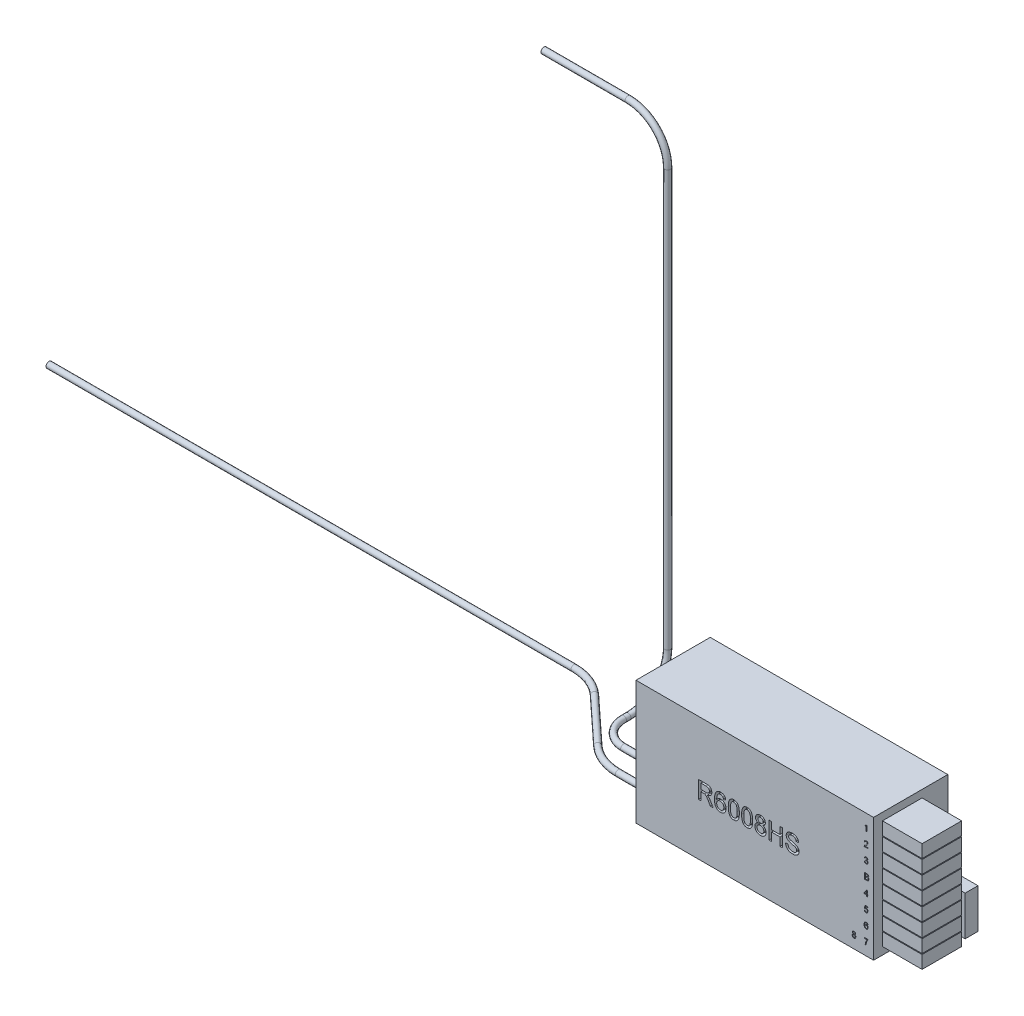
from build123d import *

# Parameters (mm, degrees)
ESQUISSE1_W             = 48
ESQUISSE1_H             = 25
BOSS_EXTRU_1_DEPTH      = 15
ESQUISSE2_W             = 8
ESQUISSE2_H             = 2.6
BOSS_EXTRU_2_DEPTH      = 8
BOSS_EXTRU_2_2_DEPTH    = 8
BOSS_EXTRU_2_3_DEPTH    = 8
BOSS_EXTRU_2_4_DEPTH    = 8
BOSS_EXTRU_2_5_DEPTH    = 8
BOSS_EXTRU_2_6_DEPTH    = 8
BOSS_EXTRU_2_7_DEPTH    = 8
BOSS_EXTRU_2_8_DEPTH    = 8
ESQUISSE2_W_2           = 2.6
ESQUISSE2_H_2           = 8
BOSS_EXTRU_2_9_DEPTH    = 8
ENL_V_MAT_EXTRU_1_DEPTH = 0.2
ENL_V_MAT_EXTRU_2_DEPTH = 0.2
ENL_V_MAT_EXTRU_3_DEPTH = 1
ESQUISSE5_R             = 0.6
ESQUISSE9_R             = 0.6


with BuildPart() as part:
    # Esquisse1 → Boss.-Extru.1 (new body)
    with BuildSketch(Plane.XY):
        with Locations((24, 0)):
            Rectangle(ESQUISSE1_W, ESQUISSE1_H)
    extrude(amount=BOSS_EXTRU_1_DEPTH)

    # Esquisse3 → Enl_v. mat.-Extru.1 (cut)
    # profile 1 of 8: a face of its own
    with BuildSketch(Plane.XY.offset(15)):
        with BuildLine():
            Line((46.665704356, 9.317215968), (46.511858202, 9.317215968))
            Line((46.511858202, 9.317215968), (46.511858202, 10.252312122))
            add(Edge.make_bspline(
                [(46.511858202, 10.252312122), (46.502999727, 10.243769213), (46.484588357, 10.226013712), (46.453465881, 10.200885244), (46.418729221, 10.175416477), (46.380829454, 10.15092541), (46.342197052, 10.127869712), (46.30486381, 10.107134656), (46.269453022, 10.089587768), (46.246127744, 10.07999306), (46.234935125, 10.075389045)],
                knots=[0, 0, 0, 0, 0.893362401, 1.856755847, 2.901947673, 4.020460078, 5.132200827, 6.168787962, 7.121294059, 8, 8, 8, 8], degree=3))
            Line((46.234935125, 10.075389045), (46.234935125, 10.217215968))
            add(Edge.make_bspline(
                [(46.234935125, 10.217215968), (46.254159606, 10.227116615), (46.29204992, 10.246630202), (46.34558074, 10.28033285), (46.395557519, 10.316867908), (46.441152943, 10.356227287), (46.482026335, 10.396459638), (46.516470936, 10.43705566), (46.545291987, 10.476527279), (46.559752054, 10.504054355), (46.566665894, 10.517215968)],
                knots=[0, 0, 0, 0, 1.141258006, 2.249351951, 3.335817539, 4.406819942, 5.426913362, 6.360259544, 7.215985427, 8, 8, 8, 8], degree=3))
            Line((46.566665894, 10.517215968), (46.665704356, 10.517215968))
            Line((46.665704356, 10.517215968), (46.665704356, 9.317215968))
        make_face()
    # profile 2 of 8: a face of its own
    with BuildSketch(Plane.XY.offset(15)):
        with BuildLine():
            Line((46.881088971, 6.624908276), (46.881088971, 6.471062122))
            Line((46.881088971, 6.471062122), (46.096473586, 6.471062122))
            add(Edge.make_bspline(
                [(46.096473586, 6.471062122), (46.096457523, 6.480205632), (46.096425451, 6.498462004), (46.099514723, 6.525462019), (46.104353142, 6.552103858), (46.10982394, 6.569188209), (46.112579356, 6.577792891)],
                knots=[0, 0, 0, 0, 1.01057331, 2.01775941, 3.001627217, 4, 4, 4, 4], degree=3))
            add(Edge.make_bspline(
                [(46.112579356, 6.577792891), (46.117670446, 6.591851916), (46.128036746, 6.620478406), (46.149038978, 6.661782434), (46.173742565, 6.702836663), (46.197794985, 6.736260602), (46.219821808, 6.762963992), (46.23829417, 6.783856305), (46.258764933, 6.805242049), (46.281217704, 6.827117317), (46.305436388, 6.849623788), (46.331454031, 6.87283652), (46.359577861, 6.896322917), (46.379211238, 6.911890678), (46.389262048, 6.919860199)],
                knots=[0, 0, 0, 0, 1.204657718, 2.452881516, 3.728232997, 5.065887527, 5.768225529, 6.518857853, 7.313994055, 8.154655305, 9.046094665, 9.979688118, 10.965752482, 12, 12, 12, 12], degree=3))
            add(Edge.make_bspline(
                [(46.389262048, 6.919860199), (46.404702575, 6.93285624), (46.434434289, 6.957880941), (46.476420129, 6.995015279), (46.514767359, 7.029496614), (46.548865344, 7.061929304), (46.578992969, 7.091998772), (46.605220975, 7.119636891), (46.627775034, 7.144757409), (46.646379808, 7.168269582), (46.662077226, 7.190471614), (46.675379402, 7.212128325), (46.686465, 7.23361801), (46.69569782, 7.25487267), (46.703000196, 7.2759832), (46.707977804, 7.297011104), (46.711353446, 7.317747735), (46.711691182, 7.331546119), (46.711858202, 7.338369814)],
                knots=[0, 0, 0, 0, 1.782554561, 3.432421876, 4.950675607, 6.337395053, 7.588547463, 8.709982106, 9.702713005, 10.569305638, 11.356701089, 12.103210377, 12.812277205, 13.490692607, 14.148717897, 14.782152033, 15.397739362, 16, 16, 16, 16], degree=3))
            add(Edge.make_bspline(
                [(46.711858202, 7.338369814), (46.711691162, 7.345113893), (46.711363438, 7.358345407), (46.708254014, 7.377709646), (46.703925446, 7.396357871), (46.69692747, 7.413954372), (46.688597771, 7.431020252), (46.677912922, 7.447016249), (46.665552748, 7.462341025), (46.651401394, 7.476590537), (46.635944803, 7.489958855), (46.618674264, 7.501071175), (46.600724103, 7.511075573), (46.581475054, 7.519119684), (46.560958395, 7.525026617), (46.539323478, 7.52931353), (46.516573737, 7.532031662), (46.501048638, 7.532408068), (46.493108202, 7.532600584)],
                knots=[0, 0, 0, 0, 0.988194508, 1.938783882, 2.870742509, 3.789494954, 4.709148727, 5.651055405, 6.603531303, 7.592354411, 8.592907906, 9.593461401, 10.59787167, 11.603930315, 12.645063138, 13.723588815, 14.835711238, 16, 16, 16, 16], degree=3))
            add(Edge.make_bspline(
                [(46.493108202, 7.532600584), (46.484766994, 7.532409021), (46.468442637, 7.53203412), (46.4445808, 7.529305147), (46.421928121, 7.525135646), (46.40053867, 7.518760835), (46.380438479, 7.510730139), (46.361709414, 7.500621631), (46.344051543, 7.489210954), (46.32802098, 7.475701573), (46.313524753, 7.460722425), (46.300655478, 7.444414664), (46.290111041, 7.426463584), (46.28140301, 7.407263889), (46.274401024, 7.386755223), (46.26931782, 7.364780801), (46.266546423, 7.34140407), (46.265989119, 7.325395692), (46.265704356, 7.317215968)],
                knots=[0, 0, 0, 0, 1.131143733, 2.213731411, 3.253917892, 4.251203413, 5.236093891, 6.184197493, 7.13373276, 8.082770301, 9.020476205, 9.957489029, 10.893177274, 11.836722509, 12.812818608, 13.827831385, 14.890097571, 16, 16, 16, 16], degree=3))
            Line((46.265704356, 7.317215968), (46.111858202, 7.332600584))
            add(Edge.make_bspline(
                [(46.111858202, 7.332600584), (46.113432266, 7.346008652), (46.116494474, 7.372092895), (46.124122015, 7.409871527), (46.134830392, 7.445016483), (46.147643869, 7.47801776), (46.16370677, 7.508313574), (46.181864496, 7.536530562), (46.203280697, 7.561773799), (46.226939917, 7.584838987), (46.253101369, 7.605165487), (46.281519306, 7.622923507), (46.312180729, 7.637776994), (46.344914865, 7.650075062), (46.379796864, 7.659405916), (46.416777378, 7.666097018), (46.455915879, 7.67022149), (46.482761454, 7.670777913), (46.496473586, 7.671062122)],
                knots=[0, 0, 0, 0, 1.130804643, 2.199883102, 3.223565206, 4.205909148, 5.160801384, 6.091796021, 7.01151579, 7.927798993, 8.855738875, 9.7815393, 10.730299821, 11.705391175, 12.706931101, 13.751121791, 14.851322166, 16, 16, 16, 16], degree=3))
            add(Edge.make_bspline(
                [(46.496473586, 7.671062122), (46.510349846, 7.670824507), (46.53738088, 7.670361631), (46.576769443, 7.665625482), (46.61393364, 7.658248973), (46.649009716, 7.647968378), (46.681790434, 7.634487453), (46.712301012, 7.618016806), (46.740682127, 7.598717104), (46.76645959, 7.576356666), (46.789703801, 7.551946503), (46.810073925, 7.525895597), (46.827104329, 7.498315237), (46.841604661, 7.469581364), (46.852360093, 7.439086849), (46.85992351, 7.407246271), (46.865063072, 7.374032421), (46.865487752, 7.351370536), (46.865704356, 7.339812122)],
                knots=[0, 0, 0, 0, 1.195390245, 2.328627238, 3.413424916, 4.457841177, 5.473507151, 6.462241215, 7.441013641, 8.425227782, 9.397253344, 10.342087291, 11.269524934, 12.186751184, 13.110685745, 14.048630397, 15.004728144, 16, 16, 16, 16], degree=3))
            add(Edge.make_bspline(
                [(46.865704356, 7.339812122), (46.865373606, 7.327937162), (46.864711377, 7.304161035), (46.859542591, 7.268622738), (46.850698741, 7.23347011), (46.838974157, 7.198275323), (46.822955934, 7.162898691), (46.80271963, 7.126852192), (46.777614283, 7.090002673), (46.753469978, 7.058676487), (46.730995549, 7.032417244), (46.711074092, 7.010804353), (46.688026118, 6.987842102), (46.662716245, 6.962735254), (46.634112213, 6.936374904), (46.603035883, 6.907971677), (46.568806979, 6.878273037), (46.545045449, 6.857984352), (46.532771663, 6.84750443)],
                knots=[0, 0, 0, 0, 0.927118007, 1.856282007, 2.79721255, 3.754929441, 4.749232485, 5.824981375, 6.979078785, 8.228161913, 8.911614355, 9.677694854, 10.522803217, 11.452009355, 12.461436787, 13.560019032, 14.739651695, 16, 16, 16, 16], degree=3))
            add(Edge.make_bspline(
                [(46.532771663, 6.84750443), (46.522261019, 6.838947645), (46.50221884, 6.822631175), (46.473704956, 6.79897675), (46.448165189, 6.777286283), (46.425002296, 6.758267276), (46.405059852, 6.740999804), (46.387635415, 6.726240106), (46.373362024, 6.713246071), (46.351626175, 6.693507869), (46.324095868, 6.665373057), (46.303810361, 6.638035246), (46.29406974, 6.624908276)],
                knots=[0, 0, 0, 0, 1.241996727, 2.368296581, 3.394949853, 4.3125351, 5.114548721, 5.812230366, 6.404953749, 6.883082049, 8.503329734, 10, 10, 10, 10], degree=3))
            Line((46.29406974, 6.624908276), (46.881088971, 6.624908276))
        make_face()
    # profile 3 of 8: a face of its own
    with BuildSketch(Plane.XY.offset(15)):
        with BuildLine():
            Line((46.127242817, 3.947985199), (46.281088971, 3.963369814))
            add(Edge.make_bspline(
                [(46.281088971, 3.963369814), (46.283139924, 3.954125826), (46.287108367, 3.936239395), (46.294744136, 3.910615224), (46.302809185, 3.886830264), (46.312807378, 3.865416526), (46.322563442, 3.845498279), (46.334028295, 3.827898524), (46.346278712, 3.812158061), (46.359541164, 3.798335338), (46.373968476, 3.786432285), (46.389368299, 3.776016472), (46.406066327, 3.767317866), (46.423934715, 3.76043069), (46.442822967, 3.754855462), (46.462833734, 3.750761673), (46.484072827, 3.748322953), (46.498630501, 3.748099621), (46.506088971, 3.747985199)],
                knots=[0, 0, 0, 0, 1.321063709, 2.556160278, 3.730472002, 4.821700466, 5.852032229, 6.822994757, 7.746964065, 8.632786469, 9.490489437, 10.352773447, 11.223141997, 12.11199479, 13.021433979, 13.96892724, 14.959401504, 16, 16, 16, 16], degree=3))
            add(Edge.make_bspline(
                [(46.506088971, 3.747985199), (46.514837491, 3.748109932), (46.531923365, 3.748353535), (46.556820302, 3.752008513), (46.580514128, 3.757027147), (46.602666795, 3.764896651), (46.623586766, 3.77451464), (46.64315486, 3.786400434), (46.661505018, 3.80035733), (46.678275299, 3.816480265), (46.693272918, 3.834216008), (46.706630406, 3.852949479), (46.717675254, 3.872840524), (46.726984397, 3.893608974), (46.733855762, 3.915590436), (46.738886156, 3.938510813), (46.742173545, 3.962473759), (46.74247406, 3.978823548), (46.742627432, 3.987167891)],
                knots=[0, 0, 0, 0, 1.111377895, 2.170522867, 3.193923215, 4.186422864, 5.152846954, 6.117443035, 7.091571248, 8.078879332, 9.069127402, 10.041602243, 10.999610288, 11.957618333, 12.930786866, 13.922135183, 14.939532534, 16, 16, 16, 16], degree=3))
            add(Edge.make_bspline(
                [(46.742627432, 3.987167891), (46.742447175, 3.995108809), (46.742094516, 4.010644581), (46.739195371, 4.033447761), (46.734136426, 4.05509413), (46.72712352, 4.075708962), (46.718162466, 4.095261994), (46.707391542, 4.113914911), (46.69421782, 4.131258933), (46.679389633, 4.147480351), (46.663216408, 4.162424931), (46.645517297, 4.175137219), (46.62689118, 4.186108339), (46.607116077, 4.194967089), (46.586274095, 4.201998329), (46.564385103, 4.20705182), (46.541343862, 4.209952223), (46.525648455, 4.210304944), (46.517627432, 4.210485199)],
                knots=[0, 0, 0, 0, 1.072815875, 2.098878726, 3.09954706, 4.07199174, 5.036203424, 6.001873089, 6.97636515, 7.972747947, 8.969130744, 9.945905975, 10.911575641, 11.885646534, 12.868345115, 13.879560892, 14.916365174, 16, 16, 16, 16], degree=3))
            add(Edge.make_bspline(
                [(46.517627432, 4.210485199), (46.510565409, 4.210298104), (46.49557815, 4.209901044), (46.471923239, 4.206395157), (46.445721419, 4.201486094), (46.427615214, 4.196668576), (46.418108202, 4.194139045)],
                knots=[0, 0, 0, 0, 0.837610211, 1.777604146, 2.833088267, 4, 4, 4, 4], degree=3))
            Line((46.418108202, 4.194139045), (46.433973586, 4.332600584))
            add(Edge.make_bspline(
                [(46.433973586, 4.332600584), (46.438136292, 4.332145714), (46.445490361, 4.331342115), (46.452881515, 4.331046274), (46.456088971, 4.330917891)],
                knots=[0, 0, 0, 0, 1.132082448, 2, 2, 2, 2], degree=3))
            add(Edge.make_bspline(
                [(46.456088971, 4.330917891), (46.470237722, 4.331458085), (46.497993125, 4.332517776), (46.538455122, 4.341322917), (46.576801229, 4.355186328), (46.606426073, 4.371727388), (46.628394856, 4.387285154), (46.642247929, 4.401312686), (46.654737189, 4.416198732), (46.664055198, 4.433273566), (46.672105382, 4.451415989), (46.677090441, 4.47134068), (46.680725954, 4.492563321), (46.680965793, 4.507262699), (46.681088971, 4.514812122)],
                knots=[0, 0, 0, 0, 1.557468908, 3.055264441, 4.54122591, 6.035034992, 6.780215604, 7.498173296, 8.201377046, 8.913174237, 9.633083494, 10.382644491, 11.169345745, 12, 12, 12, 12], degree=3))
            add(Edge.make_bspline(
                [(46.681088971, 4.514812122), (46.680975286, 4.520910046), (46.680752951, 4.532835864), (46.678276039, 4.550320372), (46.67417953, 4.566887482), (46.66864269, 4.582714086), (46.661386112, 4.597717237), (46.652387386, 4.611878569), (46.642106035, 4.625485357), (46.629969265, 4.637834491), (46.616971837, 4.649428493), (46.602639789, 4.659193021), (46.587655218, 4.667867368), (46.571489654, 4.674422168), (46.554542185, 4.679811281), (46.536667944, 4.683587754), (46.517860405, 4.686123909), (46.504975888, 4.686337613), (46.498396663, 4.686446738)],
                knots=[0, 0, 0, 0, 1.041493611, 2.036867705, 3.009952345, 3.954088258, 4.897230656, 5.850851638, 6.817653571, 7.805463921, 8.805067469, 9.788883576, 10.763797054, 11.758134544, 12.762883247, 13.799594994, 14.876406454, 16, 16, 16, 16], degree=3))
            add(Edge.make_bspline(
                [(46.498396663, 4.686446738), (46.485521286, 4.685944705), (46.460657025, 4.684975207), (46.42505847, 4.676005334), (46.392799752, 4.661490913), (46.368916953, 4.644469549), (46.351958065, 4.628196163), (46.340374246, 4.614402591), (46.330013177, 4.599170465), (46.320845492, 4.582505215), (46.312995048, 4.564339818), (46.305918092, 4.544899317), (46.300439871, 4.52387247), (46.297818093, 4.509302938), (46.296473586, 4.501831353)],
                knots=[0, 0, 0, 0, 1.533565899, 2.961543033, 4.347411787, 5.731829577, 6.434842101, 7.147085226, 7.87612511, 8.629021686, 9.412189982, 10.234506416, 11.094615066, 12, 12, 12, 12], degree=3))
            Line((46.296473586, 4.501831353), (46.142627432, 4.517215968))
            add(Edge.make_bspline(
                [(46.142627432, 4.517215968), (46.145034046, 4.52911152), (46.149754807, 4.552445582), (46.159372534, 4.586146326), (46.171101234, 4.617781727), (46.185183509, 4.647206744), (46.200954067, 4.674773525), (46.219146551, 4.700155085), (46.239334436, 4.72350232), (46.261553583, 4.744744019), (46.285502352, 4.763715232), (46.31106012, 4.780080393), (46.338017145, 4.793952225), (46.366398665, 4.805135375), (46.396182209, 4.814228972), (46.427452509, 4.820253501), (46.460068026, 4.824328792), (46.482277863, 4.824712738), (46.493588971, 4.824908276)],
                knots=[0, 0, 0, 0, 1.136581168, 2.229493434, 3.279335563, 4.293305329, 5.282068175, 6.250623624, 7.213783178, 8.169396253, 9.125981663, 10.071280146, 11.007896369, 11.961295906, 12.925420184, 13.920544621, 14.940967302, 16, 16, 16, 16], degree=3))
            add(Edge.make_bspline(
                [(46.493588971, 4.824908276), (46.509246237, 4.824400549), (46.540033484, 4.823402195), (46.585252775, 4.815473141), (46.628504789, 4.802461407), (46.669441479, 4.784424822), (46.707358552, 4.762384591), (46.740912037, 4.735970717), (46.769653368, 4.705640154), (46.793024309, 4.671724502), (46.811530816, 4.635614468), (46.825225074, 4.598130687), (46.833407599, 4.559316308), (46.834424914, 4.533038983), (46.834935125, 4.519860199)],
                knots=[0, 0, 0, 0, 1.104647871, 2.172094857, 3.229560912, 4.285649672, 5.322588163, 6.317201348, 7.289435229, 8.260615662, 9.214246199, 10.146367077, 11.070353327, 12, 12, 12, 12], degree=3))
            add(Edge.make_bspline(
                [(46.834935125, 4.519860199), (46.834417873, 4.507402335), (46.833396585, 4.48280488), (46.82553387, 4.446839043), (46.812247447, 4.412765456), (46.794289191, 4.380464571), (46.77100174, 4.350634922), (46.742449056, 4.324053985), (46.709087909, 4.300467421), (46.68408655, 4.288190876), (46.671233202, 4.28187943)],
                knots=[0, 0, 0, 0, 0.975609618, 1.926294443, 2.868398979, 3.832526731, 4.812148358, 5.820404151, 6.879456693, 8, 8, 8, 8], degree=3))
            add(Edge.make_bspline(
                [(46.671233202, 4.28187943), (46.679850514, 4.279703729), (46.696729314, 4.275442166), (46.720971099, 4.266612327), (46.743761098, 4.256274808), (46.765402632, 4.24456635), (46.785267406, 4.230719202), (46.804040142, 4.215578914), (46.821011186, 4.198416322), (46.83667222, 4.179843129), (46.850921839, 4.160053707), (46.862913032, 4.138663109), (46.873261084, 4.116233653), (46.882084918, 4.092602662), (46.888425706, 4.067587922), (46.892959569, 4.041383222), (46.895951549, 4.014079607), (46.896297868, 3.995429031), (46.896473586, 3.985965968)],
                knots=[0, 0, 0, 0, 1.053251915, 2.063013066, 3.05373318, 4.018979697, 4.975584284, 5.920798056, 6.874756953, 7.832116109, 8.799604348, 9.761196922, 10.734637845, 11.72654167, 12.747371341, 13.789206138, 14.878271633, 16, 16, 16, 16], degree=3))
            add(Edge.make_bspline(
                [(46.896473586, 3.985965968), (46.896180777, 3.973046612), (46.895605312, 3.947655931), (46.890149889, 3.910356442), (46.881234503, 3.874618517), (46.868896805, 3.840320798), (46.85326299, 3.807323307), (46.83364513, 3.776091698), (46.810624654, 3.746372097), (46.784561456, 3.718449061), (46.756006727, 3.692786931), (46.724997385, 3.670565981), (46.692146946, 3.651695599), (46.657401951, 3.636306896), (46.62085451, 3.624216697), (46.582468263, 3.615550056), (46.542124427, 3.610456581), (46.514597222, 3.609838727), (46.500560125, 3.609523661)],
                knots=[0, 0, 0, 0, 1.016055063, 1.996874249, 2.958724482, 3.910019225, 4.860394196, 5.826121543, 6.806008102, 7.814207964, 8.82789325, 9.821757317, 10.810247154, 11.803791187, 12.806673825, 13.834534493, 14.895752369, 16, 16, 16, 16], degree=3))
            add(Edge.make_bspline(
                [(46.500560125, 3.609523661), (46.487962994, 3.609760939), (46.463163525, 3.610228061), (46.426862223, 3.615094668), (46.392083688, 3.622000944), (46.35910293, 3.632647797), (46.327536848, 3.645631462), (46.297920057, 3.662242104), (46.269720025, 3.681310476), (46.243466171, 3.703381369), (46.219304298, 3.727741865), (46.197749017, 3.754031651), (46.17923935, 3.782192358), (46.162919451, 3.811802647), (46.149728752, 3.843420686), (46.139457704, 3.876775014), (46.131625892, 3.911741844), (46.128719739, 3.935772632), (46.127242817, 3.947985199)],
                knots=[0, 0, 0, 0, 1.08471039, 2.135426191, 3.150939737, 4.135689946, 5.116584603, 6.086901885, 7.055842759, 8.045878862, 9.036901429, 10.008421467, 10.96965771, 11.936653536, 12.917548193, 13.915472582, 14.940632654, 16, 16, 16, 16], degree=3))
        make_face()
    # profile 4 of 8: a face of its own
    with BuildSketch(Plane.XY.offset(15)):
        with BuildLine():
            Line((46.188781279, 0.77875443), (46.188781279, 1.97875443))
            Line((46.188781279, 1.97875443), (46.638060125, 1.97875443))
            add(Edge.make_bspline(
                [(46.638060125, 1.97875443), (46.649201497, 1.978711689), (46.670941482, 1.978628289), (46.702686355, 1.976542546), (46.73275112, 1.973689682), (46.7612005, 1.970012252), (46.787911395, 1.964676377), (46.812858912, 1.95821232), (46.836172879, 1.95075624), (46.86467065, 1.939398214), (46.897511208, 1.921915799), (46.932686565, 1.895829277), (46.963290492, 1.864508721), (46.988473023, 1.82859793), (47.009220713, 1.790238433), (47.023930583, 1.750161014), (47.033335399, 1.709238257), (47.034402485, 1.681528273), (47.034935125, 1.667696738)],
                knots=[0, 0, 0, 0, 0.939712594, 1.833646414, 2.682508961, 3.487467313, 4.25240329, 4.978730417, 5.660668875, 6.315918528, 7.564895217, 8.787077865, 9.996481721, 11.241996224, 12.475862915, 13.665015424, 14.834484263, 16, 16, 16, 16], degree=3))
            add(Edge.make_bspline(
                [(47.034935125, 1.667696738), (47.034375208, 1.65482837), (47.033260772, 1.629215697), (47.024391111, 1.591486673), (47.010392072, 1.554852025), (46.990597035, 1.519757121), (46.965296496, 1.486844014), (46.933931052, 1.457226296), (46.896951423, 1.430840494), (46.869198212, 1.416776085), (46.854887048, 1.409523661)],
                knots=[0, 0, 0, 0, 0.926741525, 1.844548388, 2.778836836, 3.746021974, 4.738420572, 5.759761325, 6.844803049, 8, 8, 8, 8], degree=3))
            add(Edge.make_bspline(
                [(46.854887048, 1.409523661), (46.863740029, 1.406752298), (46.88107266, 1.401326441), (46.905990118, 1.391397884), (46.92938, 1.380092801), (46.951293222, 1.367392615), (46.971581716, 1.353179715), (46.990188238, 1.337431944), (47.007241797, 1.320392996), (47.022711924, 1.302073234), (47.036300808, 1.28259055), (47.048488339, 1.262370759), (47.058552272, 1.24117037), (47.066801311, 1.219044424), (47.073236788, 1.196129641), (47.077858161, 1.172337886), (47.080492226, 1.147724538), (47.080887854, 1.13100419), (47.081088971, 1.12250443)],
                knots=[0, 0, 0, 0, 1.127427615, 2.20731145, 3.257257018, 4.283066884, 5.282973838, 6.264540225, 7.242620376, 8.210460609, 9.17525685, 10.12748095, 11.077310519, 12.023587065, 12.994999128, 13.967387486, 14.966724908, 16, 16, 16, 16], degree=3))
            add(Edge.make_bspline(
                [(47.081088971, 1.12250443), (47.080674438, 1.108858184), (47.079852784, 1.081809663), (47.073253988, 1.041998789), (47.062102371, 1.003704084), (47.046753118, 0.967544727), (47.028463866, 0.934110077), (47.007677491, 0.904275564), (46.984924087, 0.878348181), (46.959562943, 0.856538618), (46.931757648, 0.838028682), (46.900722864, 0.822442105), (46.866698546, 0.808696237), (46.828993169, 0.797715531), (46.787623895, 0.788992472), (46.742029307, 0.783325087), (46.692139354, 0.779267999), (46.657380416, 0.778930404), (46.639262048, 0.77875443)],
                knots=[0, 0, 0, 0, 1.028073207, 2.037766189, 3.031549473, 4.027532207, 4.992436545, 5.898794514, 6.762903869, 7.584966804, 8.412380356, 9.273953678, 10.198004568, 11.174406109, 12.229717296, 13.381036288, 14.634844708, 16, 16, 16, 16], degree=3))
            Line((46.639262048, 0.77875443), (46.188781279, 0.77875443))
        make_face()
        with BuildLine():
            Line((46.358012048, 1.471062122), (46.605367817, 1.471062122))
            add(Edge.make_bspline(
                [(46.605367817, 1.471062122), (46.613461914, 1.471094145), (46.629012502, 1.471155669), (46.651443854, 1.472013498), (46.672146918, 1.472745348), (46.691041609, 1.474582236), (46.708221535, 1.476381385), (46.723617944, 1.478803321), (46.737306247, 1.481532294), (46.745687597, 1.484063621), (46.749598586, 1.485244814)],
                knots=[0, 0, 0, 0, 1.335841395, 2.566453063, 3.705076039, 4.753984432, 5.69893722, 6.555639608, 7.326018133, 8, 8, 8, 8], degree=3))
            add(Edge.make_bspline(
                [(46.749598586, 1.485244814), (46.758788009, 1.48846387), (46.776503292, 1.494669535), (46.800243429, 1.508763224), (46.820463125, 1.525675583), (46.837108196, 1.545705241), (46.849899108, 1.568745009), (46.8593832, 1.594317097), (46.864575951, 1.622778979), (46.865317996, 1.642516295), (46.865704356, 1.652792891)],
                knots=[0, 0, 0, 0, 1.059015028, 2.041559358, 2.989777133, 3.920090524, 4.862499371, 5.848878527, 6.879979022, 8, 8, 8, 8], degree=3))
            add(Edge.make_bspline(
                [(46.865704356, 1.652792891), (46.865393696, 1.662669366), (46.864788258, 1.681917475), (46.85970614, 1.709869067), (46.850911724, 1.73587289), (46.839001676, 1.759923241), (46.823920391, 1.781319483), (46.805920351, 1.799715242), (46.784357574, 1.813621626), (46.764202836, 1.822296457), (46.746075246, 1.827723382), (46.729878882, 1.83093427), (46.711507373, 1.833763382), (46.690900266, 1.836168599), (46.668049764, 1.838035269), (46.642885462, 1.839518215), (46.615467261, 1.840147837), (46.596473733, 1.840243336), (46.586617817, 1.840292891)],
                knots=[0, 0, 0, 0, 1.216168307, 2.37017178, 3.484610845, 4.588286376, 5.664695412, 6.69777344, 7.738183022, 8.803673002, 9.390844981, 10.0665252, 10.835811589, 11.680682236, 12.621801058, 13.660007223, 14.785756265, 16, 16, 16, 16], degree=3))
            Line((46.586617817, 1.840292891), (46.358012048, 1.840292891))
            Line((46.358012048, 1.840292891), (46.358012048, 1.471062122))
        make_face(mode=Mode.SUBTRACT)
        with BuildLine():
            Line((46.358012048, 0.917215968), (46.641906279, 0.917215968))
            add(Edge.make_bspline(
                [(46.641906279, 0.917215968), (46.653204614, 0.91734577), (46.673962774, 0.917584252), (46.70235588, 0.918332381), (46.725306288, 0.920159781), (46.738708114, 0.922127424), (46.744550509, 0.922985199)],
                knots=[0, 0, 0, 0, 1.317581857, 2.420761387, 3.311546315, 4, 4, 4, 4], degree=3))
            add(Edge.make_bspline(
                [(46.744550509, 0.922985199), (46.75292677, 0.924745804), (46.769145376, 0.928154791), (46.792009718, 0.935763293), (46.81297343, 0.944479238), (46.831670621, 0.955556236), (46.848983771, 0.968321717), (46.864030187, 0.984266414), (46.87788865, 1.00238229), (46.889895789, 1.023113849), (46.899605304, 1.046048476), (46.90702612, 1.070831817), (46.910978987, 1.097376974), (46.911560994, 1.115601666), (46.911858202, 1.124908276)],
                knots=[0, 0, 0, 0, 1.067651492, 2.067249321, 3.003744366, 3.895862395, 4.774133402, 5.679610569, 6.621910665, 7.616993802, 8.661192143, 9.724711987, 10.838102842, 12, 12, 12, 12], degree=3))
            add(Edge.make_bspline(
                [(46.911858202, 1.124908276), (46.91152708, 1.135834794), (46.91088136, 1.157142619), (46.904743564, 1.187933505), (46.89460493, 1.216492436), (46.880332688, 1.242423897), (46.862827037, 1.265747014), (46.841646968, 1.285531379), (46.816950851, 1.301231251), (46.788662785, 1.313552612), (46.755599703, 1.322319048), (46.716848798, 1.328266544), (46.671790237, 1.332104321), (46.639591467, 1.332428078), (46.622435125, 1.332600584)],
                knots=[0, 0, 0, 0, 0.96167883, 1.875371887, 2.752872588, 3.621584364, 4.472914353, 5.312011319, 6.159851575, 7.038572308, 8.019870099, 9.164119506, 10.488969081, 12, 12, 12, 12], degree=3))
            Line((46.622435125, 1.332600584), (46.358012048, 1.332600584))
            Line((46.358012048, 1.332600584), (46.358012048, 0.917215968))
        make_face(mode=Mode.SUBTRACT)
    # profile 5 of 8: a face of its own
    with BuildSketch(Plane.XY.offset(15)):
        Polygon((46.588781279, -2.067399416), (46.588781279, -1.775091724), (46.065704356, -1.775091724), (46.065704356, -1.62124557), (46.634935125, -0.882784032), (46.742627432, -0.882784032), (46.742627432, -1.62124557), (46.896473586, -1.62124557), (46.896473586, -1.775091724), (46.742627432, -1.775091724), (46.742627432, -2.067399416), align=None)
        Polygon((46.588781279, -1.62124557), (46.588781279, -1.189034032), (46.255608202, -1.62124557), align=None, mode=Mode.SUBTRACT)
    # profile 6 of 8: a face of its own
    with BuildSketch(Plane.XY.offset(15)):
        with BuildLine():
            Line((46.127242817, -4.590476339), (46.281088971, -4.575091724))
            add(Edge.make_bspline(
                [(46.281088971, -4.575091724), (46.282612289, -4.58376011), (46.285575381, -4.60062147), (46.291221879, -4.625028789), (46.298555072, -4.647703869), (46.306794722, -4.668843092), (46.316588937, -4.688222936), (46.327201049, -4.706149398), (46.339715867, -4.721986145), (46.352873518, -4.736561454), (46.367315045, -4.749404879), (46.383179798, -4.76023233), (46.400025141, -4.769678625), (46.418056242, -4.777412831), (46.437300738, -4.783073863), (46.457513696, -4.787550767), (46.478955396, -4.789806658), (46.493584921, -4.790250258), (46.501040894, -4.790476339)],
                knots=[0, 0, 0, 0, 1.237781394, 2.407677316, 3.51963579, 4.58689595, 5.594855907, 6.570874, 7.510833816, 8.428091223, 9.330271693, 10.221190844, 11.124215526, 12.043132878, 12.973586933, 13.941700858, 14.950982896, 16, 16, 16, 16], degree=3))
            add(Edge.make_bspline(
                [(46.501040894, -4.790476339), (46.510187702, -4.790255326), (46.528074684, -4.789823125), (46.554096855, -4.786167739), (46.578676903, -4.780140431), (46.601697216, -4.771705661), (46.623427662, -4.761216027), (46.643147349, -4.747633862), (46.6619315, -4.732366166), (46.678571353, -4.714164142), (46.693718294, -4.694348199), (46.706791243, -4.672718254), (46.717796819, -4.649577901), (46.727062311, -4.624931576), (46.7339042, -4.598638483), (46.738936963, -4.570838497), (46.742167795, -4.541513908), (46.742472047, -4.521414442), (46.742627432, -4.511149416)],
                knots=[0, 0, 0, 0, 1.052816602, 2.058828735, 3.018813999, 3.961574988, 4.877590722, 5.788574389, 6.712363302, 7.658909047, 8.620312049, 9.580784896, 10.562948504, 11.56722449, 12.607883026, 13.686460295, 14.818448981, 16, 16, 16, 16], degree=3))
            add(Edge.make_bspline(
                [(46.742627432, -4.511149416), (46.742450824, -4.501366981), (46.742106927, -4.482318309), (46.739210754, -4.454580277), (46.734324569, -4.428498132), (46.728002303, -4.403784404), (46.719287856, -4.380825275), (46.708952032, -4.359287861), (46.696290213, -4.339629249), (46.682203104, -4.32123734), (46.666113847, -4.304749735), (46.647805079, -4.290828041), (46.627995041, -4.278643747), (46.60628474, -4.268763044), (46.582661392, -4.261422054), (46.557359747, -4.255773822), (46.530117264, -4.252803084), (46.511383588, -4.252282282), (46.501762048, -4.252014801)],
                knots=[0, 0, 0, 0, 1.165854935, 2.270189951, 3.319242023, 4.32700288, 5.306253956, 6.24172124, 7.169108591, 8.088047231, 8.999810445, 9.905349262, 10.822648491, 11.767237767, 12.739852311, 13.766490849, 14.852878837, 16, 16, 16, 16], degree=3))
            add(Edge.make_bspline(
                [(46.501762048, -4.252014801), (46.48979813, -4.252364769), (46.466854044, -4.253035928), (46.433885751, -4.258682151), (46.40387352, -4.267802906), (46.377157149, -4.28139628), (46.353287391, -4.297635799), (46.331768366, -4.316011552), (46.312422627, -4.336511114), (46.301810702, -4.351944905), (46.296473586, -4.359707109)],
                knots=[0, 0, 0, 0, 1.182877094, 2.268490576, 3.298955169, 4.273890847, 5.221533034, 6.149304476, 7.069219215, 8, 8, 8, 8], degree=3))
            Line((46.296473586, -4.359707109), (46.142627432, -4.344322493))
            Line((46.142627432, -4.344322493), (46.265704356, -3.728937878))
            Line((46.265704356, -3.728937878), (46.834935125, -3.728937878))
            Line((46.834935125, -3.728937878), (46.834935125, -3.882784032))
            Line((46.834935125, -3.882784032), (46.391425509, -3.882784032))
            Line((46.391425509, -3.882784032), (46.330367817, -4.193601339))
            add(Edge.make_bspline(
                [(46.330367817, -4.193601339), (46.338856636, -4.187231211), (46.355527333, -4.174721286), (46.381530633, -4.158341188), (46.407905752, -4.144533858), (46.434499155, -4.133226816), (46.461522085, -4.12441865), (46.488811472, -4.118299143), (46.516460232, -4.11416322), (46.535000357, -4.113757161), (46.544310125, -4.113553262)],
                knots=[0, 0, 0, 0, 1.093835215, 2.148119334, 3.164235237, 4.159999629, 5.123971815, 6.089888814, 7.040853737, 8, 8, 8, 8], degree=3))
            add(Edge.make_bspline(
                [(46.544310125, -4.113553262), (46.556426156, -4.113870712), (46.580285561, -4.114495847), (46.615443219, -4.119632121), (46.649059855, -4.128351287), (46.681399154, -4.140094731), (46.712034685, -4.155662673), (46.741276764, -4.174512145), (46.76900733, -4.196798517), (46.795069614, -4.222101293), (46.818709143, -4.250190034), (46.839867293, -4.280148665), (46.857148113, -4.312576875), (46.87168247, -4.346627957), (46.882644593, -4.382860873), (46.890965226, -4.420761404), (46.895413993, -4.460803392), (46.896114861, -4.488062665), (46.896473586, -4.502014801)],
                knots=[0, 0, 0, 0, 0.991958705, 1.953407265, 2.902004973, 3.832128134, 4.765371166, 5.71007953, 6.676509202, 7.674246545, 8.68000108, 9.679398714, 10.671856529, 11.683459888, 12.706765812, 13.76733029, 14.85725088, 16, 16, 16, 16], degree=3))
            add(Edge.make_bspline(
                [(46.896473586, -4.502014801), (46.896201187, -4.515327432), (46.89566312, -4.541623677), (46.891253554, -4.580376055), (46.88398984, -4.617717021), (46.874265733, -4.653757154), (46.861127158, -4.688291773), (46.845191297, -4.721432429), (46.826808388, -4.753524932), (46.812066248, -4.773308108), (46.804646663, -4.783264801)],
                knots=[0, 0, 0, 0, 1.059692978, 2.093196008, 3.100373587, 4.086253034, 5.061402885, 6.037282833, 7.012182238, 8, 8, 8, 8], degree=3))
            add(Edge.make_bspline(
                [(46.804646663, -4.783264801), (46.795220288, -4.794887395), (46.776677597, -4.817750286), (46.744571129, -4.847424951), (46.71005622, -4.872644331), (46.672927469, -4.89313325), (46.633434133, -4.909597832), (46.591091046, -4.920554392), (46.546409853, -4.927912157), (46.515735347, -4.928591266), (46.500079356, -4.928937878)],
                knots=[0, 0, 0, 0, 1.023140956, 2.012628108, 2.982342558, 3.942221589, 4.908720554, 5.902469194, 6.929439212, 8, 8, 8, 8], degree=3))
            add(Edge.make_bspline(
                [(46.500079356, -4.928937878), (46.487165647, -4.928675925), (46.46190384, -4.928163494), (46.424916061, -4.923708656), (46.389736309, -4.91660476), (46.356353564, -4.906415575), (46.324667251, -4.893540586), (46.295045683, -4.877184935), (46.266974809, -4.858475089), (46.241072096, -4.836834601), (46.217471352, -4.812697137), (46.196324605, -4.786574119), (46.17791803, -4.758448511), (46.16226051, -4.728488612), (46.149210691, -4.696723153), (46.139227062, -4.662935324), (46.131319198, -4.627456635), (46.128615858, -4.602932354), (46.127242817, -4.590476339)],
                knots=[0, 0, 0, 0, 1.108768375, 2.168973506, 3.19473529, 4.187459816, 5.162590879, 6.12651078, 7.088512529, 8.056012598, 9.019588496, 9.983680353, 10.938070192, 11.90157236, 12.88306954, 13.882379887, 14.924449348, 16, 16, 16, 16], degree=3))
        make_face()
    # profile 7 of 8: a face of its own
    with BuildSketch(Plane.XY.offset(15)):
        with BuildLine():
            Line((46.881088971, -6.867399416), (46.727242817, -6.882784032))
            add(Edge.make_bspline(
                [(46.727242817, -6.882784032), (46.723922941, -6.869552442), (46.717673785, -6.84464601), (46.704569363, -6.810864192), (46.69012857, -6.782290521), (46.677582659, -6.766904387), (46.671713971, -6.759707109)],
                knots=[0, 0, 0, 0, 1.199207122, 2.257322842, 3.184815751, 4, 4, 4, 4], degree=3))
            add(Edge.make_bspline(
                [(46.671713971, -6.759707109), (46.666676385, -6.754798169), (46.656768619, -6.745143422), (46.640503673, -6.73255839), (46.623357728, -6.721895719), (46.605278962, -6.713257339), (46.586365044, -6.706433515), (46.56653763, -6.701659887), (46.545841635, -6.69870474), (46.5317399, -6.698348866), (46.524598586, -6.698168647)],
                knots=[0, 0, 0, 0, 1.028360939, 2.022547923, 3.001693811, 3.976902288, 4.948369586, 5.937776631, 6.955661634, 8, 8, 8, 8], degree=3))
            add(Edge.make_bspline(
                [(46.524598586, -6.698168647), (46.513021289, -6.698541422), (46.490145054, -6.699278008), (46.456581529, -6.706489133), (46.423981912, -6.717281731), (46.403785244, -6.728222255), (46.393588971, -6.73374557)],
                knots=[0, 0, 0, 0, 1.010336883, 1.996381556, 2.988474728, 4, 4, 4, 4], degree=3))
            add(Edge.make_bspline(
                [(46.393588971, -6.73374557), (46.383561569, -6.742053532), (46.362977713, -6.759107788), (46.336115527, -6.790620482), (46.312093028, -6.827310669), (46.294376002, -6.861563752), (46.281907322, -6.892274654), (46.273843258, -6.918594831), (46.266953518, -6.947673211), (46.261213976, -6.979455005), (46.25677481, -7.013965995), (46.253064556, -7.051228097), (46.251012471, -7.091335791), (46.250555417, -7.118999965), (46.25031974, -7.133264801)],
                knots=[0, 0, 0, 0, 1.063306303, 2.18271343, 3.369442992, 4.644240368, 5.329284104, 6.077448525, 6.892756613, 7.771869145, 8.717113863, 9.73749892, 10.833357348, 12, 12, 12, 12], degree=3))
            add(Edge.make_bspline(
                [(46.25031974, -7.133264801), (46.259389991, -7.120521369), (46.277145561, -7.095575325), (46.308467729, -7.062944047), (46.34267009, -7.035360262), (46.379790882, -7.013336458), (46.41886151, -6.996267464), (46.459020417, -6.983984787), (46.500197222, -6.976445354), (46.52793257, -6.975545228), (46.541906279, -6.975091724)],
                knots=[0, 0, 0, 0, 1.083917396, 2.121834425, 3.126226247, 4.123362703, 5.106535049, 6.077135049, 7.031216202, 8, 8, 8, 8], degree=3))
            add(Edge.make_bspline(
                [(46.541906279, -6.975091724), (46.553941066, -6.975415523), (46.577718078, -6.976055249), (46.612732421, -6.98112478), (46.646300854, -6.989991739), (46.678714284, -7.00154299), (46.709349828, -7.017315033), (46.738955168, -7.035747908), (46.766844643, -7.058178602), (46.793371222, -7.083382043), (46.817522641, -7.111402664), (46.83889836, -7.141560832), (46.856711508, -7.173928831), (46.871155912, -7.208289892), (46.882461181, -7.244518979), (46.890675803, -7.282718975), (46.895484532, -7.322965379), (46.896139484, -7.350479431), (46.896473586, -7.364514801)],
                knots=[0, 0, 0, 0, 0.981553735, 1.939246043, 2.877808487, 3.810434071, 4.740031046, 5.683044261, 6.650811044, 7.654063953, 8.664382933, 9.663624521, 10.66421212, 11.671863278, 12.699354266, 13.755775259, 14.855184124, 16, 16, 16, 16], degree=3))
            add(Edge.make_bspline(
                [(46.896473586, -7.364514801), (46.895874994, -7.383063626), (46.894693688, -7.419669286), (46.885211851, -7.473576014), (46.869933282, -7.525536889), (46.851656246, -7.566685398), (46.834864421, -7.598209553), (46.820606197, -7.620258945), (46.805360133, -7.640979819), (46.789415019, -7.66065731), (46.771614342, -7.678390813), (46.75303728, -7.695015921), (46.733069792, -7.709957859), (46.712299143, -7.723713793), (46.690332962, -7.735641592), (46.667810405, -7.746240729), (46.64454607, -7.755269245), (46.620464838, -7.762358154), (46.595690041, -7.768222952), (46.570139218, -7.772255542), (46.543879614, -7.774742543), (46.52612664, -7.774974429), (46.517146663, -7.775091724)],
                knots=[0, 0, 0, 0, 1.777979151, 3.508799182, 5.232661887, 6.960203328, 7.816385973, 8.656273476, 9.47551652, 10.283326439, 11.082130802, 11.882412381, 12.672407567, 13.471692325, 14.269609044, 15.067192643, 15.857822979, 16.66013129, 17.472860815, 18.297850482, 19.139002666, 20, 20, 20, 20], degree=3))
            add(Edge.make_bspline(
                [(46.517146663, -7.775091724), (46.501981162, -7.774671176), (46.472238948, -7.773846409), (46.428706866, -7.767510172), (46.38737125, -7.756921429), (46.348144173, -7.742117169), (46.310906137, -7.723427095), (46.276024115, -7.699997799), (46.243305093, -7.672523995), (46.21272385, -7.640846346), (46.184995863, -7.60426819), (46.161298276, -7.562045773), (46.141105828, -7.514548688), (46.124580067, -7.461646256), (46.112074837, -7.403283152), (46.103070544, -7.339584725), (46.097533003, -7.270541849), (46.096834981, -7.222698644), (46.096473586, -7.197928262)],
                knots=[0, 0, 0, 0, 0.898506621, 1.76212948, 2.600594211, 3.422599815, 4.24233914, 5.064166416, 5.906856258, 6.769969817, 7.668413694, 8.619051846, 9.63165591, 10.722000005, 11.898403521, 13.164960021, 14.532183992, 16, 16, 16, 16], degree=3))
            add(Edge.make_bspline(
                [(46.096473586, -7.197928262), (46.096533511, -7.183823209), (46.096651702, -7.156003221), (46.098550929, -7.115059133), (46.100729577, -7.07551772), (46.104462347, -7.037536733), (46.108869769, -7.000945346), (46.11478447, -6.965958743), (46.121136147, -6.932304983), (46.128858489, -6.90024903), (46.137467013, -6.869489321), (46.147375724, -6.84036384), (46.157841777, -6.812495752), (46.169715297, -6.786324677), (46.182369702, -6.761424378), (46.196357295, -6.738255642), (46.21102648, -6.716288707), (46.221855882, -6.702743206), (46.227242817, -6.696005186)],
                knots=[0, 0, 0, 0, 1.28053818, 2.525659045, 3.721026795, 4.875695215, 5.990149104, 7.066600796, 8.096771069, 9.099076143, 10.059445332, 10.995815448, 11.891625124, 12.761078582, 13.603822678, 14.426062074, 15.217066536, 16, 16, 16, 16], degree=3))
            add(Edge.make_bspline(
                [(46.227242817, -6.696005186), (46.236933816, -6.68510472), (46.256035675, -6.663618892), (46.28871295, -6.635864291), (46.32353334, -6.612157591), (46.361052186, -6.59300463), (46.400982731, -6.578072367), (46.443350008, -6.567232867), (46.488272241, -6.560946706), (46.518969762, -6.560127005), (46.53469474, -6.559707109)],
                knots=[0, 0, 0, 0, 1.005002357, 1.980952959, 2.948226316, 3.90482984, 4.879026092, 5.883055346, 6.915583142, 8, 8, 8, 8], degree=3))
            add(Edge.make_bspline(
                [(46.53469474, -6.559707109), (46.546403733, -6.559914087), (46.569406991, -6.560320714), (46.603112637, -6.564222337), (46.635172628, -6.570743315), (46.665658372, -6.579539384), (46.694392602, -6.591248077), (46.721706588, -6.605124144), (46.74732298, -6.621816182), (46.771056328, -6.641096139), (46.792965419, -6.66241748), (46.812589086, -6.685959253), (46.829853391, -6.711428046), (46.84489334, -6.738876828), (46.857574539, -6.768175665), (46.867986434, -6.799450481), (46.875900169, -6.832693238), (46.879335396, -6.855670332), (46.881088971, -6.867399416)],
                knots=[0, 0, 0, 0, 1.095988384, 2.15315746, 3.171326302, 4.156539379, 5.119213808, 6.072133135, 7.021027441, 7.975952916, 8.930907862, 9.879001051, 10.840359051, 11.807350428, 12.805278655, 13.825435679, 14.889953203, 16, 16, 16, 16], degree=3))
        make_face()
        with BuildLine():
            add(Edge.make_bspline(
                [(46.25031974, -7.361389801), (46.250747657, -7.373435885), (46.251597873, -7.39736991), (46.258101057, -7.432895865), (46.268721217, -7.467557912), (46.283276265, -7.500971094), (46.301249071, -7.53201533), (46.322596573, -7.559522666), (46.346855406, -7.583089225), (46.373895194, -7.602766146), (46.40365247, -7.617887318), (46.435594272, -7.628838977), (46.469758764, -7.635458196), (46.493318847, -7.636233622), (46.505367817, -7.636630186)],
                knots=[0, 0, 0, 0, 1.034121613, 2.054667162, 3.090870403, 4.141799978, 5.178094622, 6.163726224, 7.122467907, 8.07367165, 9.024701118, 9.977919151, 10.965878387, 12, 12, 12, 12], degree=3))
            add(Edge.make_bspline(
                [(46.505367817, -7.636630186), (46.513954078, -7.63639797), (46.5307137, -7.635944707), (46.555252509, -7.632432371), (46.578665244, -7.627031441), (46.600816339, -7.619051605), (46.621675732, -7.60886714), (46.641351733, -7.596471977), (46.659831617, -7.581829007), (46.676891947, -7.564965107), (46.692310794, -7.54620942), (46.705707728, -7.525677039), (46.717538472, -7.503705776), (46.72643708, -7.479755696), (46.733688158, -7.454440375), (46.739019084, -7.427520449), (46.742148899, -7.398965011), (46.742465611, -7.379346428), (46.742627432, -7.369322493)],
                knots=[0, 0, 0, 0, 1.023436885, 1.997658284, 2.950132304, 3.883974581, 4.798406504, 5.712938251, 6.651509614, 7.604127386, 8.56812849, 9.540661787, 10.523651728, 11.536824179, 12.580180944, 13.661349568, 14.805088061, 16, 16, 16, 16], degree=3))
            add(Edge.make_bspline(
                [(46.742627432, -7.369322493), (46.742477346, -7.359696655), (46.742183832, -7.340872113), (46.738881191, -7.313403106), (46.734070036, -7.287435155), (46.726684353, -7.263186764), (46.717619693, -7.240401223), (46.706261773, -7.219248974), (46.69302765, -7.199550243), (46.677511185, -7.181826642), (46.66054282, -7.1656794), (46.641907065, -7.151653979), (46.621827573, -7.13980875), (46.600231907, -7.130111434), (46.577079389, -7.122679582), (46.552417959, -7.117529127), (46.526386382, -7.113933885), (46.5085057, -7.113682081), (46.499358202, -7.113553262)],
                knots=[0, 0, 0, 0, 1.155658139, 2.260035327, 3.319019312, 4.323913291, 5.299809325, 6.260058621, 7.202437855, 8.144128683, 9.083751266, 10.011616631, 10.939332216, 11.87851101, 12.849505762, 13.853846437, 14.90205895, 16, 16, 16, 16], degree=3))
            add(Edge.make_bspline(
                [(46.499358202, -7.113553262), (46.490851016, -7.113686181), (46.474086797, -7.11394811), (46.449501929, -7.117571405), (46.425807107, -7.122732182), (46.403096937, -7.130240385), (46.381363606, -7.139909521), (46.360611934, -7.151670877), (46.341022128, -7.16586138), (46.322415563, -7.181753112), (46.305437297, -7.199406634), (46.290541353, -7.218505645), (46.278391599, -7.23917302), (46.267770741, -7.260903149), (46.259989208, -7.284208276), (46.25445255, -7.308775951), (46.251019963, -7.334610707), (46.250556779, -7.352324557), (46.25031974, -7.361389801)],
                knots=[0, 0, 0, 0, 1.036988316, 2.04348404, 3.025371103, 3.992992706, 4.955812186, 5.923433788, 6.897355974, 7.902569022, 8.905116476, 9.880852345, 10.849905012, 11.825004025, 12.826645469, 13.839294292, 14.894236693, 16, 16, 16, 16], degree=3))
        make_face(mode=Mode.SUBTRACT)
    # profile 8 of 8: a face of its own
    with BuildSketch(Plane.XY.offset(15)):
        with BuildLine():
            Line((46.127242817, -9.575091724), (46.127242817, -9.42124557))
            Line((46.127242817, -9.42124557), (46.896473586, -9.42124557))
            Line((46.896473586, -9.42124557), (46.896473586, -9.545764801))
            add(Edge.make_bspline(
                [(46.896473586, -9.545764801), (46.887417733, -9.556354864), (46.868901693, -9.578007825), (46.842077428, -9.612497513), (46.81511378, -9.649217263), (46.788484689, -9.68852017), (46.761792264, -9.730119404), (46.735143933, -9.774147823), (46.708430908, -9.820498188), (46.673391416, -9.885397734), (46.631587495, -9.968485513), (46.588149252, -10.07086461), (46.549586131, -10.174264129), (46.529064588, -10.24458574), (46.518829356, -10.279659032)],
                knots=[0, 0, 0, 0, 0.603281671, 1.233499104, 1.891379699, 2.575603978, 3.288773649, 4.031381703, 4.80386477, 5.604951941, 7.224880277, 8.828980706, 10.418436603, 12, 12, 12, 12], degree=3))
            add(Edge.make_bspline(
                [(46.518829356, -10.279659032), (46.512191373, -10.304988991), (46.498687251, -10.356519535), (46.483904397, -10.436539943), (46.472475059, -10.519973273), (46.467986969, -10.576905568), (46.465704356, -10.605860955)],
                knots=[0, 0, 0, 0, 0.948866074, 1.930345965, 2.947387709, 4, 4, 4, 4], degree=3))
            Line((46.465704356, -10.605860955), (46.311858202, -10.605860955))
            add(Edge.make_bspline(
                [(46.311858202, -10.605860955), (46.312227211, -10.593915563), (46.312986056, -10.569350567), (46.316341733, -10.531603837), (46.320811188, -10.491981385), (46.327123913, -10.450617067), (46.335147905, -10.407426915), (46.344709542, -10.362365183), (46.356128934, -10.315525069), (46.373017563, -10.250584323), (46.398099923, -10.168926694), (46.434618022, -10.072374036), (46.476614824, -9.977478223), (46.516697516, -9.900522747), (46.550878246, -9.840595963), (46.576816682, -9.79711446), (46.603492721, -9.755681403), (46.630411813, -9.715998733), (46.657578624, -9.678033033), (46.685546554, -9.642139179), (46.713491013, -9.607596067), (46.733000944, -9.585830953), (46.742627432, -9.575091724)],
                knots=[0, 0, 0, 0, 0.630312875, 1.296201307, 1.998242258, 2.7335219, 3.502880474, 4.315318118, 5.163159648, 6.045885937, 7.85484959, 9.666009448, 11.488277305, 13.325849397, 14.240191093, 15.127469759, 15.996293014, 16.839220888, 17.656853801, 18.458354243, 19.239329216, 20, 20, 20, 20], degree=3))
            Line((46.742627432, -9.575091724), (46.127242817, -9.575091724))
        make_face()
    extrude(amount=-ENL_V_MAT_EXTRU_1_DEPTH, mode=Mode.SUBTRACT)

    # Esquisse4 → Enl_v. mat.-Extru.2 (cut)
    with BuildSketch(Plane.XY.offset(15)):
        with BuildLine():
            add(Edge.make_bspline(
                [(43.906093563, -9.936321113), (43.891496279, -9.930610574), (43.863508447, -9.919661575), (43.825760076, -9.897749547), (43.793812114, -9.872542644), (43.768056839, -9.843433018), (43.748426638, -9.811022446), (43.734292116, -9.77572416), (43.726013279, -9.73734151), (43.724923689, -9.710800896), (43.724362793, -9.697138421)],
                knots=[0, 0, 0, 0, 1.16287356, 2.229614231, 3.228817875, 4.173350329, 5.100165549, 6.029633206, 6.985702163, 8, 8, 8, 8], degree=3))
            add(Edge.make_bspline(
                [(43.724362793, -9.697138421), (43.724626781, -9.686625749), (43.725144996, -9.665989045), (43.729622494, -9.635708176), (43.736793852, -9.606691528), (43.746971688, -9.579020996), (43.759722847, -9.552468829), (43.77581266, -9.527521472), (43.7943069, -9.503473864), (43.815972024, -9.481298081), (43.839846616, -9.46098721), (43.865706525, -9.44291253), (43.893749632, -9.428131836), (43.923508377, -9.41577393), (43.955129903, -9.406098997), (43.988725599, -9.399509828), (44.024177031, -9.395318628), (44.048469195, -9.394773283), (44.060901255, -9.39449419)],
                knots=[0, 0, 0, 0, 0.994101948, 1.951453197, 2.889123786, 3.817215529, 4.736003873, 5.669743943, 6.620499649, 7.601567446, 8.596478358, 9.582687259, 10.579761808, 11.589151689, 12.62747492, 13.702346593, 14.8241243, 16, 16, 16, 16], degree=3))
            add(Edge.make_bspline(
                [(44.060901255, -9.39449419), (44.073412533, -9.394776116), (44.097783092, -9.395325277), (44.133422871, -9.399460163), (44.167230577, -9.406390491), (44.199186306, -9.416222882), (44.229340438, -9.428794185), (44.257494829, -9.444245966), (44.283939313, -9.462323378), (44.307997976, -9.483241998), (44.329888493, -9.505952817), (44.348854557, -9.530283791), (44.365121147, -9.555667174), (44.37856304, -9.582257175), (44.388507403, -9.610356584), (44.39608724, -9.639435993), (44.400483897, -9.669840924), (44.40101521, -9.690473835), (44.40128587, -9.700984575)],
                knots=[0, 0, 0, 0, 1.171211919, 2.281388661, 3.353996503, 4.398126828, 5.406889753, 6.407389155, 7.400009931, 8.40008733, 9.387021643, 10.349004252, 11.283445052, 12.206096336, 13.131640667, 14.068727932, 15.016178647, 16, 16, 16, 16], degree=3))
            add(Edge.make_bspline(
                [(44.40128587, -9.700984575), (44.400846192, -9.714176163), (44.399984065, -9.740042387), (44.391198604, -9.777328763), (44.377505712, -9.812137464), (44.357715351, -9.843805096), (44.332651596, -9.872658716), (44.301549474, -9.897741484), (44.264881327, -9.919619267), (44.237600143, -9.930603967), (44.223401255, -9.936321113)],
                knots=[0, 0, 0, 0, 0.998680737, 1.958225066, 2.887911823, 3.823713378, 4.77537694, 5.772726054, 6.840782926, 8, 8, 8, 8], degree=3))
            add(Edge.make_bspline(
                [(44.223401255, -9.936321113), (44.232359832, -9.939362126), (44.249914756, -9.945321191), (44.27473218, -9.956907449), (44.29809704, -9.969400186), (44.320141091, -9.982923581), (44.340050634, -9.998483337), (44.358489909, -10.015159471), (44.375381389, -10.033186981), (44.390494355, -10.052719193), (44.403987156, -10.073346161), (44.415538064, -10.095118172), (44.425348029, -10.117725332), (44.433731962, -10.141272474), (44.439855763, -10.16592546), (44.444140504, -10.191570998), (44.446859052, -10.218073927), (44.447244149, -10.236074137), (44.447439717, -10.245215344)],
                knots=[0, 0, 0, 0, 1.104208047, 2.163768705, 3.193778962, 4.198696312, 5.179575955, 6.14024585, 7.100368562, 8.060719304, 9.021161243, 9.975749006, 10.935506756, 11.897452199, 12.89163552, 13.897859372, 14.932451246, 16, 16, 16, 16], degree=3))
            add(Edge.make_bspline(
                [(44.447439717, -10.245215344), (44.44713398, -10.257814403), (44.446531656, -10.28263551), (44.441239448, -10.319069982), (44.433232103, -10.354070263), (44.42155647, -10.3874885), (44.406643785, -10.419348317), (44.388196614, -10.44960345), (44.366396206, -10.478222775), (44.341885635, -10.505295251), (44.314482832, -10.529767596), (44.284838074, -10.551333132), (44.252840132, -10.569397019), (44.21887725, -10.584353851), (44.182786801, -10.595945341), (44.144615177, -10.604061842), (44.104375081, -10.608894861), (44.07686015, -10.60954643), (44.062824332, -10.609878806)],
                knots=[0, 0, 0, 0, 1.017598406, 2.004746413, 2.969099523, 3.915171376, 4.859468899, 5.806714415, 6.772805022, 7.762836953, 8.753334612, 9.736396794, 10.719437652, 11.716790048, 12.730404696, 13.776887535, 14.865953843, 16, 16, 16, 16], degree=3))
            add(Edge.make_bspline(
                [(44.062824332, -10.609878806), (44.048789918, -10.609539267), (44.021277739, -10.608873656), (43.981000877, -10.604139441), (43.942883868, -10.595654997), (43.906840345, -10.584051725), (43.872674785, -10.56949985), (43.84089174, -10.551028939), (43.811053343, -10.529490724), (43.783631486, -10.50486701), (43.758917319, -10.477797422), (43.737404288, -10.448755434), (43.719066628, -10.418187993), (43.703975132, -10.385922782), (43.69247197, -10.351959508), (43.684398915, -10.316425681), (43.679097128, -10.279348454), (43.678509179, -10.254048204), (43.678208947, -10.241128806)],
                knots=[0, 0, 0, 0, 1.127066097, 2.209429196, 3.250843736, 4.258219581, 5.246860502, 6.227045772, 7.204057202, 8.19754525, 9.181483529, 10.142920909, 11.095356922, 12.039670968, 12.998174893, 13.969127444, 14.962948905, 16, 16, 16, 16], degree=3))
            add(Edge.make_bspline(
                [(43.678208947, -10.241128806), (43.678417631, -10.231509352), (43.678827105, -10.21263432), (43.681328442, -10.184949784), (43.686313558, -10.158563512), (43.692734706, -10.133320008), (43.700887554, -10.109156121), (43.710945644, -10.08626161), (43.723148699, -10.064691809), (43.737012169, -10.044306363), (43.752710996, -10.025248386), (43.769990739, -10.007684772), (43.788914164, -9.991815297), (43.809056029, -9.97717646), (43.831260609, -9.964803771), (43.854702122, -9.953449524), (43.879783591, -9.943766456), (43.89723574, -9.938827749), (43.906093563, -9.936321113)],
                knots=[0, 0, 0, 0, 1.117345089, 2.192424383, 3.22371675, 4.232639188, 5.215561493, 6.182180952, 7.132172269, 8.089790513, 9.041830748, 9.996006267, 10.94686322, 11.907506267, 12.882866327, 13.894317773, 14.931262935, 16, 16, 16, 16], degree=3))
        make_face()
        with BuildLine():
            add(Edge.make_bspline(
                [(43.878208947, -9.697859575), (43.878665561, -9.710106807), (43.879547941, -9.733773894), (43.889143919, -9.767391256), (43.904149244, -9.797589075), (43.921740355, -9.819487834), (43.938605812, -9.834408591), (43.952682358, -9.84437065), (43.968065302, -9.852828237), (43.984866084, -9.859402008), (44.002677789, -9.865225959), (44.022114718, -9.868481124), (44.042720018, -9.87112738), (44.056964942, -9.871319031), (44.06426664, -9.871417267)],
                knots=[0, 0, 0, 0, 1.528727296, 2.954179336, 4.335216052, 5.725683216, 6.435919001, 7.148062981, 7.879427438, 8.626027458, 9.402978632, 10.2190538, 11.08711833, 12, 12, 12, 12], degree=3))
            add(Edge.make_bspline(
                [(44.06426664, -9.871417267), (44.071407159, -9.8713154), (44.085330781, -9.871116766), (44.105472, -9.868524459), (44.124505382, -9.86506219), (44.142149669, -9.859815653), (44.158608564, -9.852993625), (44.173614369, -9.844583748), (44.187616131, -9.834918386), (44.203986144, -9.819883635), (44.221552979, -9.798751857), (44.23660859, -9.769903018), (44.245990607, -9.738340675), (44.2469482, -9.716355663), (44.247439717, -9.705071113)],
                knots=[0, 0, 0, 0, 0.922112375, 1.798068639, 2.620552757, 3.419964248, 4.17189205, 4.918165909, 5.639229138, 6.36503528, 7.785020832, 9.165298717, 10.544993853, 12, 12, 12, 12], degree=3))
            add(Edge.make_bspline(
                [(44.247439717, -9.705071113), (44.246847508, -9.693392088), (44.245688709, -9.670539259), (44.23632961, -9.637732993), (44.220572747, -9.608020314), (44.202572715, -9.586321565), (44.185913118, -9.570602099), (44.171659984, -9.560595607), (44.15633781, -9.552079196), (44.139888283, -9.5451244), (44.122287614, -9.539515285), (44.103488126, -9.535835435), (44.083568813, -9.533254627), (44.069884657, -9.533057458), (44.062824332, -9.532955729)],
                knots=[0, 0, 0, 0, 1.480633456, 2.897216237, 4.289382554, 5.720567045, 6.454675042, 7.191244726, 7.924224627, 8.676083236, 9.454506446, 10.26432127, 11.104478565, 12, 12, 12, 12], degree=3))
            add(Edge.make_bspline(
                [(44.062824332, -9.532955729), (44.055763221, -9.533054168), (44.041997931, -9.53324607), (44.021948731, -9.535904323), (44.00297108, -9.539243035), (43.985240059, -9.54460105), (43.968829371, -9.551602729), (43.953567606, -9.560123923), (43.939341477, -9.569874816), (43.922564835, -9.584893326), (43.904994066, -9.606025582), (43.889514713, -9.634413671), (43.879947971, -9.665366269), (43.878795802, -9.686894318), (43.878208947, -9.697859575)],
                knots=[0, 0, 0, 0, 0.914830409, 1.783417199, 2.618873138, 3.411020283, 4.179090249, 4.927874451, 5.674348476, 6.410336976, 7.841713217, 9.213201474, 10.580551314, 12, 12, 12, 12], degree=3))
        make_face(mode=Mode.SUBTRACT)
        with BuildLine():
            add(Edge.make_bspline(
                [(43.832055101, -10.23824419), (43.832321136, -10.248115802), (43.832853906, -10.267885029), (43.837527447, -10.297246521), (43.845457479, -10.326061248), (43.855621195, -10.354356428), (43.869957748, -10.380990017), (43.888969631, -10.404762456), (43.912825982, -10.424748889), (43.94007124, -10.441634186), (43.969802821, -10.454924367), (44.000783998, -10.464201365), (44.032215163, -10.470331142), (44.053421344, -10.471055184), (44.064026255, -10.471417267)],
                knots=[0, 0, 0, 0, 0.957879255, 1.91828174, 2.876792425, 3.856375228, 4.831004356, 5.799187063, 6.79220414, 7.836856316, 8.902268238, 9.943090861, 10.971368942, 12, 12, 12, 12], degree=3))
            add(Edge.make_bspline(
                [(44.064026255, -10.471417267), (44.072771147, -10.471269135), (44.08975998, -10.470981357), (44.114524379, -10.467692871), (44.137858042, -10.462703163), (44.15986787, -10.455861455), (44.180229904, -10.446501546), (44.199275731, -10.435561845), (44.216810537, -10.422340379), (44.232829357, -10.407251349), (44.247169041, -10.390560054), (44.259452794, -10.372553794), (44.270168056, -10.35373895), (44.278916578, -10.33370947), (44.28524317, -10.312424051), (44.290125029, -10.290266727), (44.29307011, -10.267008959), (44.29341655, -10.251153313), (44.293593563, -10.243051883)],
                knots=[0, 0, 0, 0, 1.149387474, 2.232932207, 3.278773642, 4.285224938, 5.256757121, 6.220082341, 7.168479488, 8.137608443, 9.109140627, 10.056190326, 10.999892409, 11.953252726, 12.923240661, 13.915357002, 14.934853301, 16, 16, 16, 16], degree=3))
            add(Edge.make_bspline(
                [(44.293593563, -10.243051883), (44.293410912, -10.234791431), (44.293053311, -10.218618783), (44.290183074, -10.194850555), (44.285027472, -10.172303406), (44.278397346, -10.150636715), (44.26941163, -10.130227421), (44.258625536, -10.110782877), (44.245416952, -10.0928156), (44.230932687, -10.075715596), (44.214541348, -10.060236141), (44.19644018, -10.046887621), (44.17720285, -10.035098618), (44.15624741, -10.026055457), (44.134035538, -10.018811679), (44.110461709, -10.01354824), (44.085429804, -10.01033084), (44.068283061, -10.010032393), (44.059458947, -10.009878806)],
                knots=[0, 0, 0, 0, 1.065858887, 2.086781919, 3.082735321, 4.047496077, 5.006086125, 5.955204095, 6.910833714, 7.878747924, 8.844339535, 9.812198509, 10.776903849, 11.749116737, 12.749729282, 13.788304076, 14.861809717, 16, 16, 16, 16], degree=3))
            add(Edge.make_bspline(
                [(44.059458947, -10.009878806), (44.050874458, -10.010033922), (44.034046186, -10.010337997), (44.009599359, -10.013573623), (43.986455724, -10.01854247), (43.964818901, -10.02581504), (43.944418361, -10.034902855), (43.925627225, -10.046330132), (43.90811026, -10.05959394), (43.892402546, -10.075010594), (43.878230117, -10.091757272), (43.865976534, -10.109709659), (43.855151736, -10.128451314), (43.846937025, -10.148597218), (43.839984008, -10.169496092), (43.835637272, -10.19155356), (43.832547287, -10.214519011), (43.832221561, -10.230220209), (43.832055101, -10.23824419)],
                knots=[0, 0, 0, 0, 1.135239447, 2.225422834, 3.256957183, 4.262780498, 5.240265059, 6.205773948, 7.16638056, 8.141101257, 9.111719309, 10.064571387, 11.014055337, 11.969087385, 12.938082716, 13.92369833, 14.938921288, 16, 16, 16, 16], degree=3))
        make_face(mode=Mode.SUBTRACT)
    extrude(amount=-ENL_V_MAT_EXTRU_2_DEPTH, mode=Mode.SUBTRACT)

    # Esquisse6 → Enl_v. mat.-Extru.3 (cut)
    # profile 1 of 7: a face of its own
    with BuildSketch(Plane.XY.offset(15)):
        with BuildLine():
            Line((12.627516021, -2.029603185), (12.627516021, 1.470396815))
            Line((12.627516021, 1.470396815), (14.146145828, 1.470396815))
            add(Edge.make_bspline(
                [(14.146145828, 1.470396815), (14.18190491, 1.470116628), (14.251112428, 1.469574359), (14.351477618, 1.465735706), (14.445158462, 1.457460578), (14.532327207, 1.448512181), (14.612968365, 1.434777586), (14.686998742, 1.419024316), (14.754532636, 1.400277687), (14.815871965, 1.378136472), (14.872781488, 1.353087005), (14.925532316, 1.322180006), (14.976317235, 1.288312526), (15.023251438, 1.248523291), (15.06757282, 1.204957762), (15.109240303, 1.157023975), (15.147637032, 1.104305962), (15.194994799, 1.028855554), (15.245800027, 0.928371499), (15.288128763, 0.799773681), (15.315421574, 0.665255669), (15.318341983, 0.573328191), (15.319823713, 0.52668688)],
                knots=[0, 0, 0, 0, 1.242255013, 2.404239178, 3.487702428, 4.508875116, 5.447164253, 6.327763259, 7.137389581, 7.87956647, 8.591787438, 9.293660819, 10.000726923, 10.709654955, 11.427269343, 12.158170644, 12.913245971, 13.690346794, 15.251572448, 16.809945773, 18.381459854, 20, 20, 20, 20], degree=3))
            add(Edge.make_bspline(
                [(15.319823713, 0.52668688), (15.319138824, 0.496747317), (15.317786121, 0.437614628), (15.307424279, 0.350673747), (15.288675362, 0.267605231), (15.264633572, 0.187681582), (15.231727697, 0.112035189), (15.193607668, 0.039120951), (15.146382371, -0.029057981), (15.09350843, -0.094317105), (15.032876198, -0.155258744), (14.963952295, -0.209684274), (14.887419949, -0.258640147), (14.802918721, -0.300775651), (14.711421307, -0.339289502), (14.611779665, -0.370302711), (14.50439594, -0.395627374), (14.429952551, -0.407890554), (14.391538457, -0.414218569)],
                knots=[0, 0, 0, 0, 0.982609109, 1.940720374, 2.867584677, 3.775009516, 4.675469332, 5.571146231, 6.471115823, 7.392408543, 8.32534739, 9.286126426, 10.269214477, 11.301811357, 12.381622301, 13.524260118, 14.722474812, 16, 16, 16, 16], degree=3))
            add(Edge.make_bspline(
                [(14.391538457, -0.414218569), (14.41971665, -0.428453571), (14.473228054, -0.455486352), (14.547315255, -0.497873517), (14.610116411, -0.541182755), (14.646500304, -0.572158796), (14.663573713, -0.586694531)],
                knots=[0, 0, 0, 0, 1.172304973, 2.226249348, 3.167654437, 4, 4, 4, 4], degree=3))
            add(Edge.make_bspline(
                [(14.663573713, -0.586694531), (14.696637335, -0.619106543), (14.764552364, -0.685683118), (14.858142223, -0.799082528), (14.948880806, -0.925313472), (15.004011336, -1.016541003), (15.032363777, -1.063457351)],
                knots=[0, 0, 0, 0, 0.918110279, 1.885863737, 2.912745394, 4, 4, 4, 4], degree=3))
            Line((15.032363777, -1.063457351), (15.606582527, -2.029603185))
            Line((15.606582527, -2.029603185), (15.040777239, -2.029603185))
            Line((15.040777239, -2.029603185), (14.604679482, -1.290620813))
            add(Edge.make_bspline(
                [(14.604679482, -1.290620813), (14.588999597, -1.264692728), (14.558614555, -1.214448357), (14.51472445, -1.141068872), (14.471691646, -1.073511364), (14.431779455, -1.009845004), (14.393368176, -0.951225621), (14.35682895, -0.897449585), (14.323167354, -0.847811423), (14.281473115, -0.790019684), (14.232947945, -0.72607259), (14.176322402, -0.660219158), (14.122398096, -0.607715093), (14.055989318, -0.556229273), (13.973732, -0.508072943), (13.903811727, -0.485946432), (13.869903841, -0.475216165)],
                knots=[0, 0, 0, 0, 1.130940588, 2.191577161, 3.191089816, 4.120344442, 4.99615009, 5.80661983, 6.546979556, 7.234477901, 8.466216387, 9.541989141, 10.473533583, 11.269175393, 12.675684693, 14, 14, 14, 14], degree=3))
            add(Edge.make_bspline(
                [(13.869903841, -0.475216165), (13.855677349, -0.472650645), (13.823197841, -0.466793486), (13.768047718, -0.462968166), (13.701226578, -0.458908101), (13.652800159, -0.459026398), (13.626614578, -0.459090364)],
                knots=[0, 0, 0, 0, 0.709978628, 1.620902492, 2.713552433, 4, 4, 4, 4], degree=3))
            Line((13.626614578, -0.459090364), (13.121105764, -0.459090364))
            Line((13.121105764, -0.459090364), (13.121105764, -2.029603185))
            Line((13.121105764, -2.029603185), (12.627516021, -2.029603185))
        make_face()
        with BuildLine():
            Line((13.121105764, -0.05524421), (14.058505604, -0.05524421))
            add(Edge.make_bspline(
                [(14.058505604, -0.05524421), (14.105510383, -0.054508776), (14.193381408, -0.05313395), (14.316255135, -0.041394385), (14.42097089, -0.022739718), (14.509598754, 0.004470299), (14.58406015, 0.042246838), (14.64882064, 0.08828461), (14.702637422, 0.145951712), (14.747407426, 0.211016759), (14.782208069, 0.282617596), (14.807311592, 0.357823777), (14.823742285, 0.436003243), (14.825396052, 0.489211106), (14.826233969, 0.516170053)],
                knots=[0, 0, 0, 0, 1.546323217, 2.890706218, 4.056530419, 5.041445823, 5.928701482, 6.793137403, 7.641659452, 8.509781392, 9.383301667, 10.251423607, 11.114044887, 12, 12, 12, 12], degree=3))
            add(Edge.make_bspline(
                [(14.826233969, 0.516170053), (14.825582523, 0.535816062), (14.824306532, 0.574296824), (14.817617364, 0.630775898), (14.804612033, 0.684444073), (14.787438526, 0.735585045), (14.764491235, 0.783824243), (14.737230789, 0.829535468), (14.704700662, 0.872465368), (14.667439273, 0.912744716), (14.624656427, 0.949394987), (14.575788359, 0.981016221), (14.521220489, 1.007887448), (14.460889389, 1.02921425), (14.394985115, 1.04627222), (14.323132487, 1.057620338), (14.245660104, 1.065831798), (14.191976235, 1.066306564), (14.164374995, 1.066550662)],
                knots=[0, 0, 0, 0, 0.965208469, 1.890559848, 2.786986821, 3.67262109, 4.535197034, 5.405224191, 6.282113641, 7.175449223, 8.095446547, 9.040936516, 10.026471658, 11.075712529, 12.17809725, 13.364958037, 14.645208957, 16, 16, 16, 16], degree=3))
            Line((14.164374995, 1.066550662), (13.121105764, 1.066550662))
            Line((13.121105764, 1.066550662), (13.121105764, -0.05524421))
        make_face(mode=Mode.SUBTRACT)
    # profile 2 of 7: a face of its own
    with BuildSketch(Plane.XY.offset(15)):
        with BuildLine():
            Line((18.14674679, 0.572960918), (17.698028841, 0.528089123))
            add(Edge.make_bspline(
                [(17.698028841, 0.528089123), (17.688345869, 0.566681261), (17.670119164, 0.63932502), (17.631897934, 0.737855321), (17.589778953, 0.821195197), (17.553186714, 0.866071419), (17.536069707, 0.887063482)],
                knots=[0, 0, 0, 0, 1.199207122, 2.257322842, 3.184815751, 4, 4, 4, 4], degree=3))
            add(Edge.make_bspline(
                [(17.536069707, 0.887063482), (17.521376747, 0.901381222), (17.492479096, 0.929540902), (17.445039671, 0.966247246), (17.395030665, 0.997346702), (17.342300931, 1.022541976), (17.287135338, 1.042444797), (17.229305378, 1.056367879), (17.168942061, 1.064987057), (17.127811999, 1.066025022), (17.106983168, 1.066550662)],
                knots=[0, 0, 0, 0, 1.028360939, 2.022547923, 3.001693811, 3.976902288, 4.948369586, 5.937776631, 6.955661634, 8, 8, 8, 8], degree=3))
            add(Edge.make_bspline(
                [(17.106983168, 1.066550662), (17.07321605, 1.065463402), (17.006493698, 1.063315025), (16.908600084, 1.042282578), (16.813517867, 1.010804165), (16.754610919, 0.978894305), (16.72487179, 0.962784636)],
                knots=[0, 0, 0, 0, 1.010336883, 1.996381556, 2.988474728, 4, 4, 4, 4], degree=3))
            add(Edge.make_bspline(
                [(16.72487179, 0.962784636), (16.695625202, 0.938553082), (16.635588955, 0.888811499), (16.557240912, 0.796899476), (16.48717529, 0.689886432), (16.43550063, 0.589981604), (16.399133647, 0.500408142), (16.37561346, 0.423640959), (16.355518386, 0.338829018), (16.338778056, 0.246132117), (16.325830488, 0.145475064), (16.315008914, 0.036793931), (16.309023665, -0.080186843), (16.30769059, -0.160874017), (16.3070032, -0.202479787)],
                knots=[0, 0, 0, 0, 1.063306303, 2.18271343, 3.369442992, 4.644240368, 5.329284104, 6.077448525, 6.892756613, 7.771869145, 8.717113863, 9.73749892, 10.833357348, 12, 12, 12, 12], degree=3))
            add(Edge.make_bspline(
                [(16.3070032, -0.202479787), (16.3334581, -0.165311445), (16.385245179, -0.092552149), (16.476601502, 0.002622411), (16.576358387, 0.083075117), (16.684627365, 0.147311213), (16.798583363, 0.19709578), (16.915713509, 0.232920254), (17.035812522, 0.254910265), (17.116707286, 0.257535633), (17.157463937, 0.258858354)],
                knots=[0, 0, 0, 0, 1.083917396, 2.121834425, 3.126226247, 4.123362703, 5.106535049, 6.077135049, 7.031216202, 8, 8, 8, 8], degree=3))
            add(Edge.make_bspline(
                [(17.157463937, 0.258858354), (17.192565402, 0.257913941), (17.261915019, 0.256048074), (17.364040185, 0.241261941), (17.461948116, 0.215399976), (17.556487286, 0.181708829), (17.645840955, 0.135707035), (17.732189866, 0.081944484), (17.813534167, 0.016521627), (17.890903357, -0.05698841), (17.961344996, -0.138715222), (18.023690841, -0.226676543), (18.075645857, -0.32108321), (18.117775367, -0.421302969), (18.15074907, -0.526971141), (18.174708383, -0.638387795), (18.188733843, -0.755773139), (18.190644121, -0.836022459), (18.191618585, -0.876958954)],
                knots=[0, 0, 0, 0, 0.981553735, 1.939246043, 2.877808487, 3.810434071, 4.740031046, 5.683044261, 6.650811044, 7.654063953, 8.664382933, 9.663624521, 10.66421212, 11.671863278, 12.699354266, 13.755775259, 14.855184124, 16, 16, 16, 16], degree=3))
            add(Edge.make_bspline(
                [(18.191618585, -0.876958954), (18.189872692, -0.931059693), (18.186427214, -1.037826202), (18.158771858, -1.195054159), (18.114209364, -1.346606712), (18.060901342, -1.466623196), (18.011925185, -1.558568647), (17.970338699, -1.622879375), (17.925871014, -1.683315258), (17.87936443, -1.740707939), (17.827445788, -1.792430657), (17.773262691, -1.840920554), (17.715024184, -1.884501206), (17.654443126, -1.924622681), (17.590375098, -1.959412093), (17.524684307, -1.990326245), (17.456829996, -2.016659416), (17.386593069, -2.0373354), (17.314333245, -2.054441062), (17.239810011, -2.066202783), (17.1632195, -2.073456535), (17.111439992, -2.074132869), (17.085248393, -2.074474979)],
                knots=[0, 0, 0, 0, 1.777979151, 3.508799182, 5.232661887, 6.960203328, 7.816385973, 8.656273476, 9.47551652, 10.283326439, 11.082130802, 11.882412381, 12.672407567, 13.471692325, 14.269609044, 15.067192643, 15.857822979, 16.66013129, 17.472860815, 18.297850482, 19.139002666, 20, 20, 20, 20], degree=3))
            add(Edge.make_bspline(
                [(17.085248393, -2.074474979), (17.041015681, -2.073248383), (16.954267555, -2.07084281), (16.827298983, -2.052362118), (16.706736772, -2.021478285), (16.592324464, -1.978299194), (16.483713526, -1.923786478), (16.381974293, -1.855451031), (16.286543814, -1.775319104), (16.197348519, -1.682925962), (16.116475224, -1.576239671), (16.047357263, -1.453090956), (15.988462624, -1.314557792), (15.940262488, -1.16025903), (15.903788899, -0.990033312), (15.877526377, -0.804246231), (15.861375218, -0.602871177), (15.859339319, -0.463328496), (15.858285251, -0.39108155)],
                knots=[0, 0, 0, 0, 0.898506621, 1.76212948, 2.600594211, 3.422599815, 4.24233914, 5.064166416, 5.906856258, 6.769969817, 7.668413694, 8.619051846, 9.63165591, 10.722000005, 11.898403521, 13.164960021, 14.532183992, 16, 16, 16, 16], degree=3))
            add(Edge.make_bspline(
                [(15.858285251, -0.39108155), (15.858460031, -0.34994181), (15.858804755, -0.268800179), (15.864344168, -0.149379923), (15.870698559, -0.0340508), (15.881585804, 0.076727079), (15.894440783, 0.183451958), (15.911691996, 0.285496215), (15.930217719, 0.383653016), (15.952741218, 0.477149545), (15.977849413, 0.566865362), (16.00674982, 0.651814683), (16.037275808, 0.733096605), (16.071906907, 0.809428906), (16.10881559, 0.882054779), (16.149612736, 0.949630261), (16.192397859, 1.013700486), (16.223983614, 1.053208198), (16.239695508, 1.072860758)],
                knots=[0, 0, 0, 0, 1.28053818, 2.525659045, 3.721026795, 4.875695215, 5.990149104, 7.066600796, 8.096771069, 9.099076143, 10.059445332, 10.995815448, 11.891625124, 12.761078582, 13.603822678, 14.426062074, 15.217066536, 16, 16, 16, 16], degree=3))
            add(Edge.make_bspline(
                [(16.239695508, 1.072860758), (16.267960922, 1.104653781), (16.323674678, 1.167320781), (16.418983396, 1.248271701), (16.520542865, 1.317416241), (16.629972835, 1.373279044), (16.746436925, 1.416831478), (16.870008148, 1.448446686), (17.001031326, 1.466781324), (17.090565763, 1.469172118), (17.136430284, 1.470396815)],
                knots=[0, 0, 0, 0, 1.005002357, 1.980952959, 2.948226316, 3.90482984, 4.879026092, 5.883055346, 6.915583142, 8, 8, 8, 8], degree=3))
            add(Edge.make_bspline(
                [(17.136430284, 1.470396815), (17.170581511, 1.469793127), (17.237674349, 1.468607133), (17.335982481, 1.457227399), (17.42949079, 1.438207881), (17.518407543, 1.412552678), (17.602215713, 1.378402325), (17.681881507, 1.337930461), (17.756595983, 1.289245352), (17.825818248, 1.233012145), (17.889719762, 1.170824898), (17.94695546, 1.102161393), (17.99730968, 1.027877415), (18.041176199, 0.947818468), (18.078163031, 0.862363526), (18.108531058, 0.771145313), (18.131612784, 0.67418727), (18.141632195, 0.607170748), (18.14674679, 0.572960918)],
                knots=[0, 0, 0, 0, 1.095988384, 2.15315746, 3.171326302, 4.156539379, 5.119213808, 6.072133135, 7.021027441, 7.975952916, 8.930907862, 9.879001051, 10.840359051, 11.807350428, 12.805278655, 13.825435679, 14.889953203, 16, 16, 16, 16], degree=3))
        make_face()
        with BuildLine():
            add(Edge.make_bspline(
                [(16.3070032, -0.86784437), (16.308251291, -0.902978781), (16.310731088, -0.972786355), (16.329698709, -1.076403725), (16.360674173, -1.17750136), (16.403126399, -1.274956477), (16.455547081, -1.365502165), (16.517810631, -1.445731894), (16.588565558, -1.51446769), (16.667431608, -1.57185871), (16.754223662, -1.615962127), (16.847387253, -1.647904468), (16.947033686, -1.667210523), (17.015750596, -1.669472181), (17.050893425, -1.670628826)],
                knots=[0, 0, 0, 0, 1.034121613, 2.054667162, 3.090870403, 4.141799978, 5.178094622, 6.163726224, 7.122467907, 8.07367165, 9.024701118, 9.977919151, 10.965878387, 12, 12, 12, 12], degree=3))
            add(Edge.make_bspline(
                [(17.050893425, -1.670628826), (17.075936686, -1.669951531), (17.124818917, -1.668629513), (17.196390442, -1.658385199), (17.264677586, -1.642632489), (17.329284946, -1.619357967), (17.390124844, -1.589653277), (17.447513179, -1.553500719), (17.501412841, -1.510792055), (17.551172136, -1.461605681), (17.596143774, -1.406901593), (17.635218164, -1.347015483), (17.669724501, -1.282932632), (17.695678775, -1.21307823), (17.716827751, -1.139241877), (17.732376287, -1.060725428), (17.741504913, -0.977438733), (17.742428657, -0.920217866), (17.742900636, -0.89098139)],
                knots=[0, 0, 0, 0, 1.023436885, 1.997658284, 2.950132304, 3.883974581, 4.798406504, 5.712938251, 6.651509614, 7.604127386, 8.56812849, 9.540661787, 10.523651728, 11.536824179, 12.580180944, 13.661349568, 14.805088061, 16, 16, 16, 16], degree=3))
            add(Edge.make_bspline(
                [(17.742900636, -0.89098139), (17.742462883, -0.862906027), (17.741606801, -0.808001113), (17.731974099, -0.727883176), (17.717941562, -0.65214332), (17.696399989, -0.581418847), (17.669961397, -0.514961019), (17.63683413, -0.45326696), (17.598234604, -0.395812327), (17.552978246, -0.344118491), (17.503487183, -0.297022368), (17.449132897, -0.25611489), (17.390567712, -0.221566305), (17.327580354, -0.193282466), (17.260052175, -0.171606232), (17.188123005, -0.156584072), (17.112197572, -0.146097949), (17.060045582, -0.145363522), (17.03336538, -0.1449878)],
                knots=[0, 0, 0, 0, 1.155658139, 2.260035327, 3.319019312, 4.323913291, 5.299809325, 6.260058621, 7.202437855, 8.144128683, 9.083751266, 10.011616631, 10.939332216, 11.87851101, 12.849505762, 13.853846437, 14.90205895, 16, 16, 16, 16], degree=3))
            add(Edge.make_bspline(
                [(17.03336538, -0.1449878), (17.008552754, -0.145375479), (16.959657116, -0.146139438), (16.887951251, -0.156707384), (16.818841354, -0.171759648), (16.752603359, -0.193658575), (16.689214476, -0.221860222), (16.628688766, -0.256164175), (16.571551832, -0.297553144), (16.517282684, -0.343904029), (16.467762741, -0.395393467), (16.424316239, -0.451098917), (16.388879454, -0.51137876), (16.357901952, -0.574758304), (16.335205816, -0.64273159), (16.319057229, -0.714387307), (16.309045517, -0.789738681), (16.307694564, -0.841404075), (16.3070032, -0.86784437)],
                knots=[0, 0, 0, 0, 1.036988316, 2.04348404, 3.025371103, 3.992992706, 4.955812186, 5.923433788, 6.897355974, 7.902569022, 8.905116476, 9.880852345, 10.849905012, 11.825004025, 12.826645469, 13.839294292, 14.894236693, 16, 16, 16, 16], degree=3))
        make_face(mode=Mode.SUBTRACT)
    # profile 3 of 7: a face of its own
    with BuildSketch(Plane.XY.offset(15)):
        with BuildLine():
            add(Edge.make_bspline(
                [(18.640336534, -0.303441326), (18.640788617, -0.253423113), (18.641674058, -0.155458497), (18.647166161, -0.012118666), (18.656754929, 0.124005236), (18.671068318, 0.252794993), (18.688018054, 0.374541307), (18.710052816, 0.489070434), (18.734845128, 0.59663934), (18.764591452, 0.6971359), (18.797272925, 0.791424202), (18.834351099, 0.879352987), (18.876069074, 0.960829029), (18.920376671, 1.03669728), (18.969606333, 1.105777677), (19.020786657, 1.170008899), (19.077637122, 1.227035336), (19.137793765, 1.278324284), (19.202142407, 1.323583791), (19.270342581, 1.362637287), (19.34213187, 1.397118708), (19.4188785, 1.423076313), (19.498989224, 1.444237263), (19.583080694, 1.459803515), (19.671245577, 1.468980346), (19.731493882, 1.469919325), (19.762131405, 1.470396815)],
                knots=[0, 0, 0, 0, 1.514747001, 2.966751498, 4.343369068, 5.64627492, 6.890416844, 8.064737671, 9.177176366, 10.232018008, 11.237056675, 12.19799043, 13.119080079, 14.007588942, 14.855863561, 15.685992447, 16.491747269, 17.290132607, 18.077525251, 18.870243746, 19.668095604, 20.485086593, 21.319398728, 22.175900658, 23.072407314, 24, 24, 24, 24], degree=3))
            add(Edge.make_bspline(
                [(19.762131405, 1.470396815), (19.807080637, 1.46907534), (19.895385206, 1.466479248), (20.024310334, 1.445305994), (20.145813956, 1.40908588), (20.259817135, 1.360223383), (20.364371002, 1.298158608), (20.457742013, 1.222709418), (20.538923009, 1.134668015), (20.607028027, 1.032991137), (20.66655861, 0.920483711), (20.719444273, 0.796640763), (20.767251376, 0.661601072), (20.801176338, 0.540721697), (20.825374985, 0.436374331), (20.841392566, 0.350311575), (20.85469037, 0.257449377), (20.864878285, 0.158012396), (20.873237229, 0.052112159), (20.879692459, -0.06031727), (20.882969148, -0.179556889), (20.883601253, -0.261372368), (20.883926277, -0.303441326)],
                knots=[0, 0, 0, 0, 1.134486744, 2.228744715, 3.287356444, 4.328707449, 5.352829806, 6.347195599, 7.349461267, 8.364207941, 9.428085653, 10.559314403, 11.761222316, 13.04268526, 13.726896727, 14.465273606, 15.252205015, 16.094778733, 16.988606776, 17.934225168, 18.937792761, 20, 20, 20, 20], degree=3))
            add(Edge.make_bspline(
                [(20.883926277, -0.303441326), (20.883465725, -0.353224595), (20.882565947, -0.450486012), (20.877221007, -0.5926765), (20.86705445, -0.727773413), (20.854544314, -0.856086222), (20.835619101, -0.977272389), (20.815226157, -1.091846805), (20.790005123, -1.199289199), (20.760578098, -1.299646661), (20.727436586, -1.393449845), (20.691091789, -1.481407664), (20.650836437, -1.563460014), (20.605472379, -1.638806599), (20.557075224, -1.708447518), (20.505290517, -1.772644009), (20.449020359, -1.830472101), (20.388321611, -1.881607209), (20.324424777, -1.927669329), (20.256058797, -1.967108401), (20.183522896, -1.999782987), (20.107301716, -2.027718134), (20.026621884, -2.048187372), (19.942119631, -2.063856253), (19.853483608, -2.073083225), (19.793002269, -2.074004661), (19.762131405, -2.074474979)],
                knots=[0, 0, 0, 0, 1.508974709, 2.94807912, 4.311757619, 5.615040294, 6.854280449, 8.028314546, 9.141715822, 10.197470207, 11.196696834, 12.155719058, 13.080757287, 13.963948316, 14.818758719, 15.649605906, 16.461113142, 17.260189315, 18.052359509, 18.845763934, 19.647754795, 20.461145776, 21.303032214, 22.167241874, 23.064524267, 24, 24, 24, 24], degree=3))
            add(Edge.make_bspline(
                [(19.762131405, -2.074474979), (19.721656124, -2.07332042), (19.642740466, -2.071069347), (19.527489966, -2.05577469), (19.419321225, -2.028855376), (19.3173219, -1.99275278), (19.222638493, -1.94446348), (19.134818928, -1.885710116), (19.052098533, -1.817859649), (19.004479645, -1.764327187), (18.980380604, -1.737235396)],
                knots=[0, 0, 0, 0, 1.10322584, 2.150986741, 3.161425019, 4.136713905, 5.093944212, 6.049774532, 7.013026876, 8, 8, 8, 8], degree=3))
            add(Edge.make_bspline(
                [(18.980380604, -1.737235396), (18.952642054, -1.697222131), (18.895443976, -1.614713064), (18.828498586, -1.474027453), (18.768782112, -1.319152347), (18.721915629, -1.147049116), (18.68520749, -0.959087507), (18.658695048, -0.754898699), (18.643691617, -0.534570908), (18.641480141, -0.382223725), (18.640336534, -0.303441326)],
                knots=[0, 0, 0, 0, 0.779365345, 1.607084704, 2.489375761, 3.438383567, 4.461919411, 5.557722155, 6.737039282, 8, 8, 8, 8], degree=3))
        make_face()
        with BuildLine():
            add(Edge.make_bspline(
                [(19.089054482, -0.302039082), (19.089500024, -0.369356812), (19.090352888, -0.498217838), (19.099263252, -0.682318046), (19.114602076, -0.848401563), (19.134881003, -0.996238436), (19.161657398, -1.126028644), (19.195278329, -1.237441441), (19.233177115, -1.331814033), (19.280076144, -1.407976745), (19.331425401, -1.470060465), (19.384439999, -1.523454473), (19.44036719, -1.568838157), (19.498842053, -1.606678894), (19.560771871, -1.635329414), (19.625479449, -1.656095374), (19.692978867, -1.668045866), (19.738949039, -1.669762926), (19.762131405, -1.670628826)],
                knots=[0, 0, 0, 0, 1.89448813, 3.626469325, 5.185477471, 6.587276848, 7.82441448, 8.910550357, 9.859733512, 10.6775885, 11.416198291, 12.123144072, 12.791880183, 13.439617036, 14.078171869, 14.70637855, 15.347637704, 16, 16, 16, 16], degree=3))
            add(Edge.make_bspline(
                [(19.762131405, -1.670628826), (19.785307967, -1.669744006), (19.831266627, -1.667989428), (19.898922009, -1.656302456), (19.963377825, -1.634467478), (20.025215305, -1.605918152), (20.084115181, -1.568939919), (20.139767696, -1.523384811), (20.193061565, -1.470022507), (20.244180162, -1.407217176), (20.290721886, -1.330702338), (20.329331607, -1.236406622), (20.362428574, -1.124798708), (20.389351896, -0.995074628), (20.409714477, -0.847471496), (20.424960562, -0.681848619), (20.433930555, -0.497985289), (20.434769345, -0.369357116), (20.435208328, -0.302039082)],
                knots=[0, 0, 0, 0, 0.652509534, 1.29391342, 1.924290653, 2.562989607, 3.207355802, 3.876242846, 4.583348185, 5.32723334, 6.150888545, 7.094226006, 8.186903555, 9.424320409, 10.81992305, 12.379283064, 14.105084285, 16, 16, 16, 16], degree=3))
            add(Edge.make_bspline(
                [(20.435208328, -0.302039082), (20.4347834, -0.236121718), (20.433969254, -0.109826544), (20.424767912, 0.070726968), (20.410348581, 0.234022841), (20.390625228, 0.380211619), (20.364412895, 0.509134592), (20.332620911, 0.621066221), (20.294736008, 0.715767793), (20.249690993, 0.794190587), (20.199546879, 0.858518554), (20.147166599, 0.914200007), (20.091240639, 0.961555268), (20.030778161, 0.999544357), (19.967727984, 1.030192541), (19.900641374, 1.051285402), (19.830177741, 1.064244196), (19.781819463, 1.065773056), (19.757223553, 1.066550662)],
                knots=[0, 0, 0, 0, 1.850066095, 3.544656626, 5.0727657, 6.45041401, 7.682899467, 8.762389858, 9.712573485, 10.538438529, 11.291566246, 11.996865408, 12.681389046, 13.341983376, 13.996294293, 14.643563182, 15.31009126, 16, 16, 16, 16], degree=3))
            add(Edge.make_bspline(
                [(19.757223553, 1.066550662), (19.734042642, 1.065942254), (19.688332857, 1.064742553), (19.621407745, 1.053291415), (19.557983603, 1.03414256), (19.497333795, 1.008203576), (19.440972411, 0.973294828), (19.386664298, 0.932536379), (19.336953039, 0.882876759), (19.306997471, 0.845752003), (19.291678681, 0.826767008)],
                knots=[0, 0, 0, 0, 1.021318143, 2.013908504, 2.982026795, 3.937174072, 4.91255697, 5.897578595, 6.924855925, 8, 8, 8, 8], degree=3))
            add(Edge.make_bspline(
                [(19.291678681, 0.826767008), (19.275001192, 0.798883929), (19.239781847, 0.740000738), (19.200373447, 0.637659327), (19.165561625, 0.520702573), (19.136899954, 0.387331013), (19.116165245, 0.237773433), (19.099795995, 0.072203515), (19.091292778, -0.109609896), (19.089821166, -0.236126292), (19.089054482, -0.302039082)],
                knots=[0, 0, 0, 0, 0.671104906, 1.417232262, 2.260109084, 3.195198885, 4.23592645, 5.382417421, 6.636286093, 8, 8, 8, 8], degree=3))
        make_face(mode=Mode.SUBTRACT)
    # profile 4 of 7: a face of its own
    with BuildSketch(Plane.XY.offset(15)):
        with BuildLine():
            add(Edge.make_bspline(
                [(21.332644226, -0.303441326), (21.333096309, -0.253423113), (21.33398175, -0.155458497), (21.339473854, -0.012118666), (21.349062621, 0.124005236), (21.363376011, 0.252794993), (21.380325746, 0.374541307), (21.402360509, 0.489070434), (21.42715282, 0.59663934), (21.456899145, 0.6971359), (21.489580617, 0.791424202), (21.526658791, 0.879352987), (21.568376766, 0.960829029), (21.612684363, 1.03669728), (21.661914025, 1.105777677), (21.713094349, 1.170008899), (21.769944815, 1.227035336), (21.830101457, 1.278324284), (21.8944501, 1.323583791), (21.962650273, 1.362637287), (22.034439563, 1.397118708), (22.111186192, 1.423076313), (22.191296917, 1.444237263), (22.275388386, 1.459803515), (22.36355327, 1.468980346), (22.423801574, 1.469919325), (22.454439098, 1.470396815)],
                knots=[0, 0, 0, 0, 1.514747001, 2.966751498, 4.343369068, 5.64627492, 6.890416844, 8.064737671, 9.177176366, 10.232018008, 11.237056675, 12.19799043, 13.119080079, 14.007588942, 14.855863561, 15.685992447, 16.491747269, 17.290132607, 18.077525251, 18.870243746, 19.668095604, 20.485086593, 21.319398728, 22.175900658, 23.072407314, 24, 24, 24, 24], degree=3))
            add(Edge.make_bspline(
                [(22.454439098, 1.470396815), (22.49938833, 1.46907534), (22.587692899, 1.466479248), (22.716618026, 1.445305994), (22.838121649, 1.40908588), (22.952124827, 1.360223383), (23.056678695, 1.298158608), (23.150049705, 1.222709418), (23.231230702, 1.134668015), (23.299335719, 1.032991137), (23.358866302, 0.920483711), (23.411751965, 0.796640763), (23.459559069, 0.661601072), (23.49348403, 0.540721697), (23.517682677, 0.436374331), (23.533700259, 0.350311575), (23.546998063, 0.257449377), (23.557185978, 0.158012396), (23.565544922, 0.052112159), (23.572000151, -0.06031727), (23.575276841, -0.179556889), (23.575908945, -0.261372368), (23.576233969, -0.303441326)],
                knots=[0, 0, 0, 0, 1.134486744, 2.228744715, 3.287356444, 4.328707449, 5.352829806, 6.347195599, 7.349461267, 8.364207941, 9.428085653, 10.559314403, 11.761222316, 13.04268526, 13.726896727, 14.465273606, 15.252205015, 16.094778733, 16.988606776, 17.934225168, 18.937792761, 20, 20, 20, 20], degree=3))
            add(Edge.make_bspline(
                [(23.576233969, -0.303441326), (23.575773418, -0.353224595), (23.574873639, -0.450486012), (23.5695287, -0.5926765), (23.559362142, -0.727773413), (23.546852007, -0.856086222), (23.527926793, -0.977272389), (23.507533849, -1.091846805), (23.482312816, -1.199289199), (23.452885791, -1.299646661), (23.419744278, -1.393449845), (23.383399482, -1.481407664), (23.34314413, -1.563460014), (23.297780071, -1.638806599), (23.249382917, -1.708447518), (23.197598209, -1.772644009), (23.141328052, -1.830472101), (23.080629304, -1.881607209), (23.01673247, -1.927669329), (22.948366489, -1.967108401), (22.875830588, -1.999782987), (22.799609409, -2.027718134), (22.718929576, -2.048187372), (22.634427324, -2.063856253), (22.545791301, -2.073083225), (22.485309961, -2.074004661), (22.454439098, -2.074474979)],
                knots=[0, 0, 0, 0, 1.508974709, 2.94807912, 4.311757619, 5.615040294, 6.854280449, 8.028314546, 9.141715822, 10.197470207, 11.196696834, 12.155719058, 13.080757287, 13.963948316, 14.818758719, 15.649605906, 16.461113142, 17.260189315, 18.052359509, 18.845763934, 19.647754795, 20.461145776, 21.303032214, 22.167241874, 23.064524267, 24, 24, 24, 24], degree=3))
            add(Edge.make_bspline(
                [(22.454439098, -2.074474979), (22.413963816, -2.07332042), (22.335048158, -2.071069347), (22.219797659, -2.05577469), (22.111628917, -2.028855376), (22.009629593, -1.99275278), (21.914946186, -1.94446348), (21.82712662, -1.885710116), (21.744406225, -1.817859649), (21.696787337, -1.764327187), (21.672688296, -1.737235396)],
                knots=[0, 0, 0, 0, 1.10322584, 2.150986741, 3.161425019, 4.136713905, 5.093944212, 6.049774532, 7.013026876, 8, 8, 8, 8], degree=3))
            add(Edge.make_bspline(
                [(21.672688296, -1.737235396), (21.644949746, -1.697222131), (21.587751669, -1.614713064), (21.520806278, -1.474027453), (21.461089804, -1.319152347), (21.414223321, -1.147049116), (21.377515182, -0.959087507), (21.351002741, -0.754898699), (21.335999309, -0.534570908), (21.333787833, -0.382223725), (21.332644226, -0.303441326)],
                knots=[0, 0, 0, 0, 0.779365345, 1.607084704, 2.489375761, 3.438383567, 4.461919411, 5.557722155, 6.737039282, 8, 8, 8, 8], degree=3))
        make_face()
        with BuildLine():
            add(Edge.make_bspline(
                [(21.781362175, -0.302039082), (21.781807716, -0.369356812), (21.78266058, -0.498217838), (21.791570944, -0.682318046), (21.806909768, -0.848401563), (21.827188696, -0.996238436), (21.853965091, -1.126028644), (21.887586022, -1.237441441), (21.925484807, -1.331814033), (21.972383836, -1.407976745), (22.023733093, -1.470060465), (22.076747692, -1.523454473), (22.132674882, -1.568838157), (22.191149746, -1.606678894), (22.253079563, -1.635329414), (22.317787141, -1.656095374), (22.38528656, -1.668045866), (22.431256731, -1.669762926), (22.454439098, -1.670628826)],
                knots=[0, 0, 0, 0, 1.89448813, 3.626469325, 5.185477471, 6.587276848, 7.82441448, 8.910550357, 9.859733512, 10.6775885, 11.416198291, 12.123144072, 12.791880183, 13.439617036, 14.078171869, 14.70637855, 15.347637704, 16, 16, 16, 16], degree=3))
            add(Edge.make_bspline(
                [(22.454439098, -1.670628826), (22.477615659, -1.669744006), (22.523574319, -1.667989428), (22.591229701, -1.656302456), (22.655685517, -1.634467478), (22.717522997, -1.605918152), (22.776422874, -1.568939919), (22.832075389, -1.523384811), (22.885369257, -1.470022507), (22.936487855, -1.407217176), (22.983029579, -1.330702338), (23.021639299, -1.236406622), (23.054736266, -1.124798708), (23.081659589, -0.995074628), (23.10202217, -0.847471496), (23.117268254, -0.681848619), (23.126238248, -0.497985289), (23.127077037, -0.369357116), (23.127516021, -0.302039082)],
                knots=[0, 0, 0, 0, 0.652509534, 1.29391342, 1.924290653, 2.562989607, 3.207355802, 3.876242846, 4.583348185, 5.32723334, 6.150888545, 7.094226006, 8.186903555, 9.424320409, 10.81992305, 12.379283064, 14.105084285, 16, 16, 16, 16], degree=3))
            add(Edge.make_bspline(
                [(23.127516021, -0.302039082), (23.127091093, -0.236121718), (23.126276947, -0.109826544), (23.117075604, 0.070726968), (23.102656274, 0.234022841), (23.08293292, 0.380211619), (23.056720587, 0.509134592), (23.024928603, 0.621066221), (22.9870437, 0.715767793), (22.941998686, 0.794190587), (22.891854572, 0.858518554), (22.839474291, 0.914200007), (22.783548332, 0.961555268), (22.723085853, 0.999544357), (22.660035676, 1.030192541), (22.592949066, 1.051285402), (22.522485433, 1.064244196), (22.474127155, 1.065773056), (22.449531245, 1.066550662)],
                knots=[0, 0, 0, 0, 1.850066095, 3.544656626, 5.0727657, 6.45041401, 7.682899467, 8.762389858, 9.712573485, 10.538438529, 11.291566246, 11.996865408, 12.681389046, 13.341983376, 13.996294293, 14.643563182, 15.31009126, 16, 16, 16, 16], degree=3))
            add(Edge.make_bspline(
                [(22.449531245, 1.066550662), (22.426350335, 1.065942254), (22.380640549, 1.064742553), (22.313715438, 1.053291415), (22.250291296, 1.03414256), (22.189641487, 1.008203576), (22.133280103, 0.973294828), (22.078971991, 0.932536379), (22.029260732, 0.882876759), (21.999305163, 0.845752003), (21.983986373, 0.826767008)],
                knots=[0, 0, 0, 0, 1.021318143, 2.013908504, 2.982026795, 3.937174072, 4.91255697, 5.897578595, 6.924855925, 8, 8, 8, 8], degree=3))
            add(Edge.make_bspline(
                [(21.983986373, 0.826767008), (21.967308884, 0.798883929), (21.932089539, 0.740000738), (21.89268114, 0.637659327), (21.857869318, 0.520702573), (21.829207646, 0.387331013), (21.808472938, 0.237773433), (21.792103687, 0.072203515), (21.783600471, -0.109609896), (21.782128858, -0.236126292), (21.781362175, -0.302039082)],
                knots=[0, 0, 0, 0, 0.671104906, 1.417232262, 2.260109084, 3.195198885, 4.23592645, 5.382417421, 6.636286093, 8, 8, 8, 8], degree=3))
        make_face(mode=Mode.SUBTRACT)
    # profile 5 of 7: a face of its own
    with BuildSketch(Plane.XY.offset(15)):
        with BuildLine():
            add(Edge.make_bspline(
                [(24.68961538, -0.10993171), (24.64703997, -0.093275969), (24.565408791, -0.061341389), (24.455309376, 0.002568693), (24.36212782, 0.076088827), (24.28700827, 0.160991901), (24.229753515, 0.255522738), (24.188527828, 0.358476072), (24.16438122, 0.470425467), (24.161203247, 0.54783559), (24.159567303, 0.587684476)],
                knots=[0, 0, 0, 0, 1.16287356, 2.229614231, 3.228817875, 4.173350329, 5.100165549, 6.029633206, 6.985702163, 8, 8, 8, 8], degree=3))
            add(Edge.make_bspline(
                [(24.159567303, 0.587684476), (24.160337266, 0.618346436), (24.161848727, 0.678536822), (24.174908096, 0.766856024), (24.195824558, 0.851487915), (24.22550991, 0.932193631), (24.262700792, 1.009637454), (24.309629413, 1.082400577), (24.363570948, 1.152539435), (24.426760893, 1.217218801), (24.496395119, 1.27645884), (24.571819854, 1.329176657), (24.653612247, 1.372287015), (24.740408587, 1.408330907), (24.832638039, 1.436549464), (24.930625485, 1.455767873), (25.034025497, 1.467992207), (25.104877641, 1.469582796), (25.141137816, 1.470396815)],
                knots=[0, 0, 0, 0, 0.994101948, 1.951453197, 2.889123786, 3.817215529, 4.736003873, 5.669743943, 6.620499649, 7.601567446, 8.596478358, 9.582687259, 10.579761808, 11.589151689, 12.62747492, 13.702346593, 14.8241243, 16, 16, 16, 16], degree=3))
            add(Edge.make_bspline(
                [(25.141137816, 1.470396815), (25.177629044, 1.469574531), (25.248709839, 1.467972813), (25.352659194, 1.455912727), (25.451265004, 1.435699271), (25.544469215, 1.407021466), (25.632418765, 1.370355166), (25.71453574, 1.325287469), (25.791665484, 1.272561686), (25.861836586, 1.211549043), (25.925683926, 1.145309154), (25.981001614, 1.074343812), (26.028445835, 1.000308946), (26.067651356, 0.922754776), (26.096655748, 0.840798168), (26.118763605, 0.755983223), (26.131587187, 0.667302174), (26.133136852, 0.607122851), (26.133926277, 0.576466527)],
                knots=[0, 0, 0, 0, 1.171211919, 2.281388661, 3.353996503, 4.398126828, 5.406889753, 6.407389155, 7.400009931, 8.40008733, 9.387021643, 10.349004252, 11.283445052, 12.206096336, 13.131640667, 14.068727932, 15.016178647, 16, 16, 16, 16], degree=3))
            add(Edge.make_bspline(
                [(26.133926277, 0.576466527), (26.132643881, 0.537991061), (26.130129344, 0.462547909), (26.104505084, 0.353795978), (26.064567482, 0.252270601), (26.006845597, 0.159906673), (25.933742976, 0.075750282), (25.843028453, 0.002592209), (25.736079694, -0.061217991), (25.656509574, -0.093256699), (25.615096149, -0.10993171)],
                knots=[0, 0, 0, 0, 0.998680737, 1.958225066, 2.887911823, 3.823713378, 4.77537694, 5.772726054, 6.840782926, 8, 8, 8, 8], degree=3))
            add(Edge.make_bspline(
                [(25.615096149, -0.10993171), (25.641225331, -0.11880133), (25.692427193, -0.136181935), (25.764811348, -0.169975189), (25.832958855, -0.206412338), (25.897254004, -0.245855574), (25.955323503, -0.291238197), (26.009104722, -0.339876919), (26.05837154, -0.392457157), (26.102451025, -0.44942611), (26.141805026, -0.509588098), (26.175495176, -0.573089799), (26.204107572, -0.639027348), (26.228560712, -0.70770651), (26.246421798, -0.779611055), (26.25891896, -0.854410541), (26.266848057, -0.93171075), (26.267971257, -0.984211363), (26.268541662, -1.010873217)],
                knots=[0, 0, 0, 0, 1.104208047, 2.163768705, 3.193778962, 4.198696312, 5.179575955, 6.14024585, 7.100368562, 8.060719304, 9.021161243, 9.975749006, 10.935506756, 11.897452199, 12.89163552, 13.897859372, 14.932451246, 16, 16, 16, 16], degree=3))
            add(Edge.make_bspline(
                [(26.268541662, -1.010873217), (26.267649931, -1.047620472), (26.265893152, -1.120015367), (26.250457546, -1.226282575), (26.22710279, -1.32836673), (26.193048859, -1.425836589), (26.149553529, -1.518761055), (26.09574928, -1.607005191), (26.032164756, -1.690478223), (25.960675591, -1.769439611), (25.880750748, -1.840817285), (25.794286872, -1.903716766), (25.700959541, -1.9564031), (25.601901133, -2.000027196), (25.496637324, -2.033835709), (25.385303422, -2.057508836), (25.267936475, -2.071605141), (25.187684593, -2.07350555), (25.14674679, -2.074474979)],
                knots=[0, 0, 0, 0, 1.017598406, 2.004746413, 2.969099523, 3.915171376, 4.859468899, 5.806714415, 6.772805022, 7.762836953, 8.753334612, 9.736396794, 10.719437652, 11.716790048, 12.730404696, 13.776887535, 14.865953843, 16, 16, 16, 16], degree=3))
            add(Edge.make_bspline(
                [(25.14674679, -2.074474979), (25.105813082, -2.073484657), (25.025569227, -2.071543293), (24.908095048, -2.057735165), (24.796920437, -2.032988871), (24.691793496, -1.999145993), (24.592143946, -1.956703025), (24.499443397, -1.902829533), (24.41241474, -1.840009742), (24.332434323, -1.768190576), (24.260351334, -1.689237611), (24.197604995, -1.604531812), (24.144120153, -1.515376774), (24.100103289, -1.421269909), (24.066552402, -1.32221036), (24.043005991, -1.218570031), (24.027542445, -1.110428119), (24.025827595, -1.036635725), (24.024951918, -0.998954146)],
                knots=[0, 0, 0, 0, 1.127066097, 2.209429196, 3.250843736, 4.258219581, 5.246860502, 6.227045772, 7.204057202, 8.19754525, 9.181483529, 10.142920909, 11.095356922, 12.039670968, 12.998174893, 13.969127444, 14.962948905, 16, 16, 16, 16], degree=3))
            add(Edge.make_bspline(
                [(24.024951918, -0.998954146), (24.025560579, -0.970897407), (24.026754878, -0.91584523), (24.034050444, -0.835098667), (24.048590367, -0.758138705), (24.067318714, -0.684511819), (24.091097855, -0.614033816), (24.120433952, -0.547258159), (24.156026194, -0.484346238), (24.196461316, -0.424888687), (24.242249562, -0.36930292), (24.292648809, -0.318075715), (24.347842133, -0.271789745), (24.406589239, -0.229093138), (24.471352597, -0.193006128), (24.539723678, -0.159889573), (24.612877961, -0.131647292), (24.663780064, -0.117242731), (24.68961538, -0.10993171)],
                knots=[0, 0, 0, 0, 1.117345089, 2.192424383, 3.22371675, 4.232639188, 5.215561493, 6.182180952, 7.132172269, 8.089790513, 9.041830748, 9.996006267, 10.94686322, 11.907506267, 12.882866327, 13.894317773, 14.931262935, 16, 16, 16, 16], degree=3))
        make_face()
        with BuildLine():
            add(Edge.make_bspline(
                [(24.608285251, 0.58558111), (24.609617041, 0.549860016), (24.61219065, 0.480831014), (24.64017892, 0.382780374), (24.683944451, 0.294703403), (24.735251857, 0.230832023), (24.784442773, 0.187313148), (24.825499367, 0.158257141), (24.870366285, 0.133589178), (24.919368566, 0.114415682), (24.971319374, 0.097429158), (25.028010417, 0.087934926), (25.088109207, 0.080216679), (25.129656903, 0.079657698), (25.150953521, 0.079371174)],
                knots=[0, 0, 0, 0, 1.528727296, 2.954179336, 4.335216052, 5.725683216, 6.435919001, 7.148062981, 7.879427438, 8.626027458, 9.402978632, 10.2190538, 11.08711833, 12, 12, 12, 12], degree=3))
            add(Edge.make_bspline(
                [(25.150953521, 0.079371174), (25.171780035, 0.079668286), (25.212390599, 0.080247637), (25.271135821, 0.087808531), (25.326649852, 0.097906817), (25.378112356, 0.113209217), (25.426117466, 0.133106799), (25.469884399, 0.157635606), (25.510722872, 0.185826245), (25.558468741, 0.229677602), (25.609705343, 0.291311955), (25.653617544, 0.375454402), (25.680981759, 0.467511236), (25.683774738, 0.531634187), (25.685208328, 0.564547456)],
                knots=[0, 0, 0, 0, 0.922112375, 1.798068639, 2.620552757, 3.419964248, 4.17189205, 4.918165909, 5.639229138, 6.36503528, 7.785020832, 9.165298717, 10.544993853, 12, 12, 12, 12], degree=3))
            add(Edge.make_bspline(
                [(25.685208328, 0.564547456), (25.683481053, 0.598611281), (25.680101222, 0.665265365), (25.65280385, 0.760950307), (25.606846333, 0.847612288), (25.554346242, 0.910900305), (25.50575575, 0.956748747), (25.464184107, 0.985934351), (25.419494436, 1.010773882), (25.371516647, 1.031058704), (25.320181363, 1.047418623), (25.265349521, 1.058151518), (25.207251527, 1.065678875), (25.167339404, 1.066253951), (25.14674679, 1.066550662)],
                knots=[0, 0, 0, 0, 1.480633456, 2.897216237, 4.289382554, 5.720567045, 6.454675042, 7.191244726, 7.924224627, 8.676083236, 9.454506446, 10.26432127, 11.104478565, 12, 12, 12, 12], degree=3))
            add(Edge.make_bspline(
                [(25.14674679, 1.066550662), (25.126151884, 1.066263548), (25.086003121, 1.065703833), (25.027526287, 1.057950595), (24.972174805, 1.048212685), (24.920459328, 1.032585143), (24.872594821, 1.012163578), (24.828081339, 0.987310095), (24.786588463, 0.958869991), (24.73765659, 0.915066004), (24.686408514, 0.853430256), (24.6412604, 0.770631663), (24.613357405, 0.680353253), (24.609996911, 0.617563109), (24.608285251, 0.58558111)],
                knots=[0, 0, 0, 0, 0.914830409, 1.783417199, 2.618873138, 3.411020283, 4.179090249, 4.927874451, 5.674348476, 6.410336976, 7.841713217, 9.213201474, 10.580551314, 12, 12, 12, 12], degree=3))
        make_face(mode=Mode.SUBTRACT)
        with BuildLine():
            add(Edge.make_bspline(
                [(24.473669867, -0.990540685), (24.474445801, -1.019332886), (24.475999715, -1.076993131), (24.489630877, -1.162630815), (24.512760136, -1.246673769), (24.542404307, -1.329201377), (24.584219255, -1.40688268), (24.639670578, -1.476218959), (24.709251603, -1.534512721), (24.788716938, -1.583761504), (24.87543405, -1.622524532), (24.965795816, -1.649582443), (25.057470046, -1.667460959), (25.11932141, -1.669572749), (25.150252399, -1.670628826)],
                knots=[0, 0, 0, 0, 0.957879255, 1.91828174, 2.876792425, 3.856375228, 4.831004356, 5.799187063, 6.79220414, 7.836856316, 8.902268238, 9.943090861, 10.971368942, 12, 12, 12, 12], degree=3))
            add(Edge.make_bspline(
                [(25.150252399, -1.670628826), (25.175758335, -1.670196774), (25.225309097, -1.66935742), (25.297538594, -1.659766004), (25.36559511, -1.645212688), (25.429790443, -1.625257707), (25.489179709, -1.597957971), (25.544730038, -1.56605051), (25.595873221, -1.527487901), (25.642594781, -1.48347823), (25.684418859, -1.434795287), (25.720246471, -1.382277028), (25.75149932, -1.327400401), (25.777015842, -1.268981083), (25.795468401, -1.20689861), (25.809707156, -1.142273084), (25.818296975, -1.074437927), (25.819307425, -1.028192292), (25.819823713, -1.00456312)],
                knots=[0, 0, 0, 0, 1.149387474, 2.232932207, 3.278773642, 4.285224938, 5.256757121, 6.220082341, 7.168479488, 8.137608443, 9.109140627, 10.056190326, 10.999892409, 11.953252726, 12.923240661, 13.915357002, 14.934853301, 16, 16, 16, 16], degree=3))
            add(Edge.make_bspline(
                [(25.819823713, -1.00456312), (25.819290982, -0.980470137), (25.81824798, -0.933299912), (25.809876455, -0.863975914), (25.794839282, -0.798213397), (25.775501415, -0.735018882), (25.749293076, -0.675491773), (25.717833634, -0.618778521), (25.679308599, -0.566373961), (25.637062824, -0.516498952), (25.589254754, -0.47135054), (25.536459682, -0.432417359), (25.480350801, -0.398032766), (25.419230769, -0.37165688), (25.354446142, -0.350529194), (25.285689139, -0.335177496), (25.212679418, -0.325793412), (25.162668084, -0.324922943), (25.136931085, -0.324474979)],
                knots=[0, 0, 0, 0, 1.065858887, 2.086781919, 3.082735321, 4.047496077, 5.006086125, 5.955204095, 6.910833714, 7.878747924, 8.844339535, 9.812198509, 10.776903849, 11.749116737, 12.749729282, 13.788304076, 14.861809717, 16, 16, 16, 16], degree=3))
            add(Edge.make_bspline(
                [(25.136931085, -0.324474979), (25.111892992, -0.324927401), (25.062810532, -0.325814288), (24.991507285, -0.335251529), (24.924005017, -0.349744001), (24.860897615, -0.370955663), (24.801396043, -0.39746179), (24.746588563, -0.430791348), (24.695497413, -0.469477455), (24.649683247, -0.514442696), (24.608346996, -0.563287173), (24.57260738, -0.615648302), (24.541035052, -0.670311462), (24.517075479, -0.72907035), (24.496795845, -0.790025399), (24.484117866, -0.854359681), (24.475105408, -0.921342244), (24.474155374, -0.967137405), (24.473669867, -0.990540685)],
                knots=[0, 0, 0, 0, 1.135239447, 2.225422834, 3.256957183, 4.262780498, 5.240265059, 6.205773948, 7.16638056, 8.141101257, 9.111719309, 10.064571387, 11.014055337, 11.969087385, 12.938082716, 13.92369833, 14.938921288, 16, 16, 16, 16], degree=3))
        make_face(mode=Mode.SUBTRACT)
    # profile 6 of 7: a face of its own
    with BuildSketch(Plane.XY.offset(15)):
        Polygon((26.89674679, -2.029603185), (26.89674679, 1.470396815), (27.390336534, 1.470396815), (27.390336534, 0.03449938), (29.095464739, 0.03449938), (29.095464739, 1.470396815), (29.589054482, 1.470396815), (29.589054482, -2.029603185), (29.095464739, -2.029603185), (29.095464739, -0.369346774), (27.390336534, -0.369346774), (27.390336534, -2.029603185), align=None)
    # profile 7 of 7: a face of its own
    with BuildSketch(Plane.XY.offset(15)):
        with BuildLine():
            Line((30.21725961, -0.818064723), (30.710849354, -0.818064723))
            add(Edge.make_bspline(
                [(30.710849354, -0.818064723), (30.716278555, -0.862382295), (30.726708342, -0.947518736), (30.755871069, -1.068186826), (30.793405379, -1.176679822), (30.840172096, -1.274437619), (30.901691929, -1.360288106), (30.975812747, -1.437723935), (31.065828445, -1.504778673), (31.167435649, -1.564452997), (31.280597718, -1.61130678), (31.401408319, -1.64604026), (31.529291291, -1.666620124), (31.61685768, -1.66927381), (31.661570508, -1.670628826)],
                knots=[0, 0, 0, 0, 1.125557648, 2.162256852, 3.1243583, 4.018160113, 4.88511607, 5.777380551, 6.711250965, 7.707237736, 8.743031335, 9.791730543, 10.872421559, 12, 12, 12, 12], degree=3))
            add(Edge.make_bspline(
                [(31.661570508, -1.670628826), (31.70113751, -1.669896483), (31.778285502, -1.668468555), (31.889888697, -1.651315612), (31.994907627, -1.626984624), (32.091387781, -1.590180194), (32.178973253, -1.545488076), (32.255031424, -1.491431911), (32.319965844, -1.430471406), (32.370814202, -1.361000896), (32.410759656, -1.288207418), (32.440063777, -1.213383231), (32.457519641, -1.136943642), (32.459743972, -1.085511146), (32.460849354, -1.059951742)],
                knots=[0, 0, 0, 0, 1.267006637, 2.470417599, 3.611360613, 4.716023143, 5.771382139, 6.754486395, 7.697536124, 8.612899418, 9.501261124, 10.352596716, 11.181322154, 12, 12, 12, 12], degree=3))
            add(Edge.make_bspline(
                [(32.460849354, -1.059951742), (32.45966768, -1.034651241), (32.457358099, -0.985201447), (32.442307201, -0.913208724), (32.413700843, -0.847314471), (32.376580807, -0.784829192), (32.324940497, -0.727699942), (32.259698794, -0.675060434), (32.179418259, -0.627336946), (32.119500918, -0.601200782), (32.087852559, -0.587395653)],
                knots=[0, 0, 0, 0, 0.942140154, 1.841411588, 2.718743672, 3.605002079, 4.535543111, 5.568170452, 6.715506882, 8, 8, 8, 8], degree=3))
            add(Edge.make_bspline(
                [(32.087852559, -0.587395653), (32.075521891, -0.582335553), (32.047664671, -0.570903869), (31.999918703, -0.555770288), (31.943262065, -0.536201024), (31.876333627, -0.516047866), (31.799491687, -0.494728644), (31.712864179, -0.470598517), (31.616499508, -0.444937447), (31.513130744, -0.417624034), (31.408759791, -0.389850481), (31.309045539, -0.362050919), (31.217303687, -0.333830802), (31.132782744, -0.306658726), (31.055918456, -0.279374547), (30.986492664, -0.252725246), (30.92441881, -0.227251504), (30.886506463, -0.208521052), (30.868601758, -0.1996753)],
                knots=[0, 0, 0, 0, 0.499201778, 1.127787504, 1.87543728, 2.745208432, 3.745951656, 4.863402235, 6.114490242, 7.482339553, 8.869366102, 10.161191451, 11.360587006, 12.46547846, 13.487450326, 14.41601931, 15.251940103, 16, 16, 16, 16], degree=3))
            add(Edge.make_bspline(
                [(30.868601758, -0.1996753), (30.827408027, -0.17742126), (30.747893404, -0.13446517), (30.640875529, -0.057659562), (30.550702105, 0.027570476), (30.477753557, 0.121101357), (30.420586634, 0.221351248), (30.38201636, 0.328490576), (30.355598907, 0.440574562), (30.353130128, 0.517649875), (30.351874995, 0.556835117)],
                knots=[0, 0, 0, 0, 1.158441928, 2.236094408, 3.251151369, 4.220012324, 5.163146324, 6.095083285, 7.031536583, 8, 8, 8, 8], degree=3))
            add(Edge.make_bspline(
                [(30.351874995, 0.556835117), (30.353540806, 0.600226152), (30.356854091, 0.686530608), (30.386244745, 0.813177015), (30.433123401, 0.935044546), (30.486485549, 1.031796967), (30.538525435, 1.104960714), (30.581666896, 1.157651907), (30.630058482, 1.206357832), (30.6822099, 1.251758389), (30.739053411, 1.293175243), (30.799178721, 1.332310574), (30.86476203, 1.365948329), (30.956916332, 1.4087616), (31.080196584, 1.451514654), (31.235391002, 1.488768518), (31.398728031, 1.510706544), (31.510062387, 1.513726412), (31.566919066, 1.51526861)],
                knots=[0, 0, 0, 0, 1.199927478, 2.386647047, 3.578628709, 4.806592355, 5.433127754, 6.062729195, 6.689531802, 7.331674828, 7.974827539, 8.635320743, 9.315455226, 10.01318112, 11.447700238, 12.918145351, 14.426146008, 16, 16, 16, 16], degree=3))
            add(Edge.make_bspline(
                [(31.566919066, 1.51526861), (31.629152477, 1.513842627), (31.750332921, 1.511065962), (31.926411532, 1.487964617), (32.090644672, 1.448293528), (32.219441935, 1.403885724), (32.314660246, 1.358928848), (32.382305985, 1.323849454), (32.445094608, 1.283291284), (32.503591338, 1.239400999), (32.558339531, 1.192198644), (32.607932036, 1.140561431), (32.654522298, 1.086251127), (32.709272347, 1.008278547), (32.768304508, 0.905082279), (32.819345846, 0.771387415), (32.854411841, 0.630283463), (32.861232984, 0.532734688), (32.864695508, 0.483217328)],
                knots=[0, 0, 0, 0, 1.607600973, 3.130308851, 4.577334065, 5.967726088, 6.640410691, 7.296826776, 7.935019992, 8.569057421, 9.185393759, 9.8003086, 10.417295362, 11.032210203, 12.259799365, 13.477607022, 14.719591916, 16, 16, 16, 16], degree=3))
            Line((32.864695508, 0.483217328), (32.371105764, 0.483217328))
            add(Edge.make_bspline(
                [(32.371105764, 0.483217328), (32.367969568, 0.508279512), (32.361832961, 0.557318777), (32.346608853, 0.628310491), (32.325267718, 0.694244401), (32.300270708, 0.755735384), (32.2699691, 0.812143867), (32.234646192, 0.864011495), (32.193871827, 0.910727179), (32.148695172, 0.953525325), (32.09774151, 0.990790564), (32.041272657, 1.023137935), (31.979193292, 1.050464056), (31.911558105, 1.072845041), (31.838353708, 1.090198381), (31.759413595, 1.10296383), (31.674768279, 1.109501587), (31.616474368, 1.110770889), (31.586550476, 1.111422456)],
                knots=[0, 0, 0, 0, 1.074487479, 2.102453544, 3.083708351, 4.020042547, 4.923259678, 5.803182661, 6.684453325, 7.556870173, 8.445961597, 9.363679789, 10.320905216, 11.327237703, 12.390948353, 13.519046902, 14.726457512, 16, 16, 16, 16], degree=3))
            add(Edge.make_bspline(
                [(31.586550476, 1.111422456), (31.555445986, 1.111188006), (31.495235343, 1.110734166), (31.408194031, 1.102461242), (31.327517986, 1.091110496), (31.253345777, 1.074367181), (31.185920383, 1.052450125), (31.124241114, 1.027140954), (31.07003413, 0.995067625), (31.022035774, 0.959342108), (30.980631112, 0.919813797), (30.944946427, 0.878160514), (30.913386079, 0.835606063), (30.888862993, 0.789824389), (30.868897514, 0.742549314), (30.856017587, 0.692892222), (30.846898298, 0.641771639), (30.845949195, 0.60689104), (30.845464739, 0.589086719)],
                knots=[0, 0, 0, 0, 1.464176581, 2.834285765, 4.113735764, 5.29917439, 6.409476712, 7.449999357, 8.431575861, 9.367089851, 10.262376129, 11.120706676, 11.948504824, 12.751342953, 13.560717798, 14.359016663, 15.162382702, 16, 16, 16, 16], degree=3))
            add(Edge.make_bspline(
                [(30.845464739, 0.589086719), (30.846740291, 0.558974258), (30.84921602, 0.500528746), (30.874496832, 0.417495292), (30.913378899, 0.341804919), (30.95168393, 0.300622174), (30.97096554, 0.279892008)],
                knots=[0, 0, 0, 0, 1.050964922, 2.039826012, 3.013306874, 4, 4, 4, 4], degree=3))
            add(Edge.make_bspline(
                [(30.97096554, 0.279892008), (30.983120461, 0.269532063), (31.01000032, 0.246621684), (31.06001444, 0.21630248), (31.122024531, 0.185668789), (31.196444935, 0.155216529), (31.283147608, 0.124576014), (31.381992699, 0.093027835), (31.493356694, 0.061694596), (31.613845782, 0.031499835), (31.735567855, 0.001183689), (31.851244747, -0.029016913), (31.957455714, -0.057638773), (32.054032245, -0.085554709), (32.1410743, -0.112685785), (32.218279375, -0.139600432), (32.28627209, -0.16435508), (32.32792566, -0.181771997), (32.347267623, -0.189859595)],
                knots=[0, 0, 0, 0, 0.523891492, 1.158553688, 1.913783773, 2.794766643, 3.797521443, 4.933638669, 6.202080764, 7.596537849, 9.013317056, 10.322179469, 11.523240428, 12.626146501, 13.623953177, 14.517289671, 15.311498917, 16, 16, 16, 16], degree=3))
            add(Edge.make_bspline(
                [(32.347267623, -0.189859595), (32.372432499, -0.201462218), (32.421826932, -0.224236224), (32.491800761, -0.263119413), (32.557093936, -0.303497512), (32.617178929, -0.346457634), (32.671861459, -0.392090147), (32.72175294, -0.439872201), (32.767154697, -0.489535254), (32.806234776, -0.542668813), (32.841324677, -0.597124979), (32.872030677, -0.653664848), (32.896754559, -0.712620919), (32.918438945, -0.773282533), (32.934036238, -0.836324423), (32.946267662, -0.901109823), (32.953402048, -0.967943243), (32.954090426, -1.013193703), (32.954439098, -1.036113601)],
                knots=[0, 0, 0, 0, 1.198900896, 2.353241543, 3.461831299, 4.520043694, 5.547003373, 6.541368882, 7.508191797, 8.454912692, 9.392021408, 10.310662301, 11.235020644, 12.156274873, 13.095836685, 14.042125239, 15.00831306, 16, 16, 16, 16], degree=3))
            add(Edge.make_bspline(
                [(32.954439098, -1.036113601), (32.952612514, -1.081855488), (32.948986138, -1.172668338), (32.917761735, -1.306530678), (32.868709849, -1.436242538), (32.811184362, -1.539176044), (32.75680539, -1.617802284), (32.711124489, -1.674315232), (32.660466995, -1.726570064), (32.606080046, -1.776203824), (32.547541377, -1.822203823), (32.484357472, -1.864585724), (32.417195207, -1.903790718), (32.32128918, -1.951564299), (32.193910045, -2.001540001), (32.031654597, -2.043158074), (31.860657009, -2.070156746), (31.743239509, -2.073015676), (31.683305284, -2.074474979)],
                knots=[0, 0, 0, 0, 1.197055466, 2.376552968, 3.581957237, 4.820753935, 5.454298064, 6.085440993, 6.72202542, 7.359198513, 8.013298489, 8.67051481, 9.351020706, 10.049282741, 11.476266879, 12.925760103, 14.430794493, 16, 16, 16, 16], degree=3))
            add(Edge.make_bspline(
                [(31.683305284, -2.074474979), (31.645197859, -2.0741605), (31.570550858, -2.073544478), (31.460865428, -2.066084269), (31.355751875, -2.055292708), (31.255313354, -2.039218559), (31.15986483, -2.018130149), (31.069063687, -1.992807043), (30.9826947, -1.963642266), (30.901059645, -1.929344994), (30.824371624, -1.88949531), (30.751251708, -1.846507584), (30.682895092, -1.797778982), (30.619157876, -1.744075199), (30.558425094, -1.68694769), (30.50321394, -1.624063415), (30.451647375, -1.557261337), (30.404903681, -1.485930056), (30.363145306, -1.411002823), (30.32559263, -1.33373796), (30.293953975, -1.25357497), (30.26845623, -1.170918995), (30.246858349, -1.086323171), (30.231880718, -0.999081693), (30.220868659, -0.909468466), (30.218469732, -0.848712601), (30.21725961, -0.818064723)],
                knots=[0, 0, 0, 0, 1.259822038, 2.467811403, 3.633536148, 4.752793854, 5.829021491, 6.863980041, 7.868367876, 8.841470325, 9.788447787, 10.724101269, 11.643985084, 12.560193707, 13.478453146, 14.398077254, 15.323914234, 16.266973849, 17.21495974, 18.158525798, 19.105629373, 20.061269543, 21.017128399, 21.990322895, 22.986232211, 24, 24, 24, 24], degree=3))
        make_face()
    extrude(amount=-ENL_V_MAT_EXTRU_3_DEPTH, mode=Mode.SUBTRACT)

    # Balayage2: sweep along a curve in space
    with BuildLine() as balayage2_path:
        Line((0, -8, 12.5), (-6.079004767, -8, 12.5))
        ThreePointArc((-6.079004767, -8, 12.5), (-9.729417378, -8, 11.809913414), (-12.876009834, -8, 9.834897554))
        Line((-12.876009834, -8, 9.834897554), (-22.123990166, -8, 1.265102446))
        ThreePointArc((-22.123990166, -8, 1.265102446), (-25.270582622, -8, -0.709913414), (-28.920995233, -8, -1.4))
        Line((-28.920995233, -8, -1.4), (-135, -8, -1.4))
    # Esquisse5 → Balayage2 (sweep)
    with BuildSketch(Plane.ZY):
        with Locations((12.5, -8)):
            Circle(ESQUISSE5_R)
    sweep(path=balayage2_path.line)

    # Balayage3: sweep along a curve in space
    with BuildLine() as balayage3_path:
        Line((0, -3, 12.5), (-5, -3, 12.5))
        ThreePointArc((-5, -3, 12.5), (-8.535533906, -3, 11.035533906), (-10, -3, 7.5))
        Line((-10, -3, 7.5), (-10, -3, 6.6))
        ThreePointArc((-10, -3, 6.6), (-10, -0.656854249, 0.943145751), (-10, 5, -1.4))
        Line((-10, 5, -1.4), (-10, 89, -1.4))
        ThreePointArc((-10, 89, -1.4), (-12.343145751, 94.656854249, -1.4), (-18, 97, -1.4))
        Line((-18, 97, -1.4), (-35, 97, -1.4))
    # Esquisse9 → Balayage3 (sweep)
    with BuildSketch(Plane.ZY):
        with Locations((12.5, -3)):
            Circle(ESQUISSE9_R)
    sweep(path=balayage3_path.line)


with BuildPart() as body_2:
    # Esquisse2 → Boss.-Extru.2 (new body)
    with BuildSketch(Plane(origin=(48, 0, 0), x_dir=(0, 0, -1), z_dir=(1, 0, 0))):
        with Locations((-9.2, 9.7)):
            Rectangle(ESQUISSE2_W, ESQUISSE2_H)
    extrude(amount=BOSS_EXTRU_2_DEPTH)


with BuildPart() as body_3:
    # Esquisse2 → Boss.-Extru.2 2 (new body)
    with BuildSketch(Plane(origin=(48, 0, 0), x_dir=(0, 0, -1), z_dir=(1, 0, 0))):
        with Locations((-9.2, 6.928571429)):
            Rectangle(ESQUISSE2_W, ESQUISSE2_H)
    extrude(amount=BOSS_EXTRU_2_2_DEPTH)


with BuildPart() as body_4:
    # Esquisse2 → Boss.-Extru.2 3 (new body)
    with BuildSketch(Plane(origin=(48, 0, 0), x_dir=(0, 0, -1), z_dir=(1, 0, 0))):
        with Locations((-9.2, 4.157142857)):
            Rectangle(ESQUISSE2_W, ESQUISSE2_H)
    extrude(amount=BOSS_EXTRU_2_3_DEPTH)


with BuildPart() as body_5:
    # Esquisse2 → Boss.-Extru.2 4 (new body)
    with BuildSketch(Plane(origin=(48, 0, 0), x_dir=(0, 0, -1), z_dir=(1, 0, 0))):
        with Locations((-9.2, 1.385714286)):
            Rectangle(ESQUISSE2_W, ESQUISSE2_H)
    extrude(amount=BOSS_EXTRU_2_4_DEPTH)


with BuildPart() as body_6:
    # Esquisse2 → Boss.-Extru.2 5 (new body)
    with BuildSketch(Plane(origin=(48, 0, 0), x_dir=(0, 0, -1), z_dir=(1, 0, 0))):
        with Locations((-9.2, -1.385714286)):
            Rectangle(ESQUISSE2_W, ESQUISSE2_H)
    extrude(amount=BOSS_EXTRU_2_5_DEPTH)


with BuildPart() as body_7:
    # Esquisse2 → Boss.-Extru.2 6 (new body)
    with BuildSketch(Plane(origin=(48, 0, 0), x_dir=(0, 0, -1), z_dir=(1, 0, 0))):
        with Locations((-9.2, -4.157142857)):
            Rectangle(ESQUISSE2_W, ESQUISSE2_H)
    extrude(amount=BOSS_EXTRU_2_6_DEPTH)


with BuildPart() as body_8:
    # Esquisse2 → Boss.-Extru.2 7 (new body)
    with BuildSketch(Plane(origin=(48, 0, 0), x_dir=(0, 0, -1), z_dir=(1, 0, 0))):
        with Locations((-9.2, -6.928571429)):
            Rectangle(ESQUISSE2_W, ESQUISSE2_H)
    extrude(amount=BOSS_EXTRU_2_7_DEPTH)


with BuildPart() as body_9:
    # Esquisse2 → Boss.-Extru.2 8 (new body)
    with BuildSketch(Plane(origin=(48, 0, 0), x_dir=(0, 0, -1), z_dir=(1, 0, 0))):
        with Locations((-9.2, -9.7)):
            Rectangle(ESQUISSE2_W, ESQUISSE2_H)
    extrude(amount=BOSS_EXTRU_2_8_DEPTH)


with BuildPart() as body_10:
    # Esquisse2 → Boss.-Extru.2 9 (new body)
    with BuildSketch(Plane(origin=(48, 0, 0), x_dir=(0, 0, -1), z_dir=(1, 0, 0))):
        with Locations((-3.2, -6)):
            Rectangle(ESQUISSE2_W_2, ESQUISSE2_H_2)
    extrude(amount=BOSS_EXTRU_2_9_DEPTH)


solid = Compound([part.part, body_2.part, body_3.part, body_4.part, body_5.part, body_6.part, body_7.part, body_8.part, body_9.part, body_10.part])
